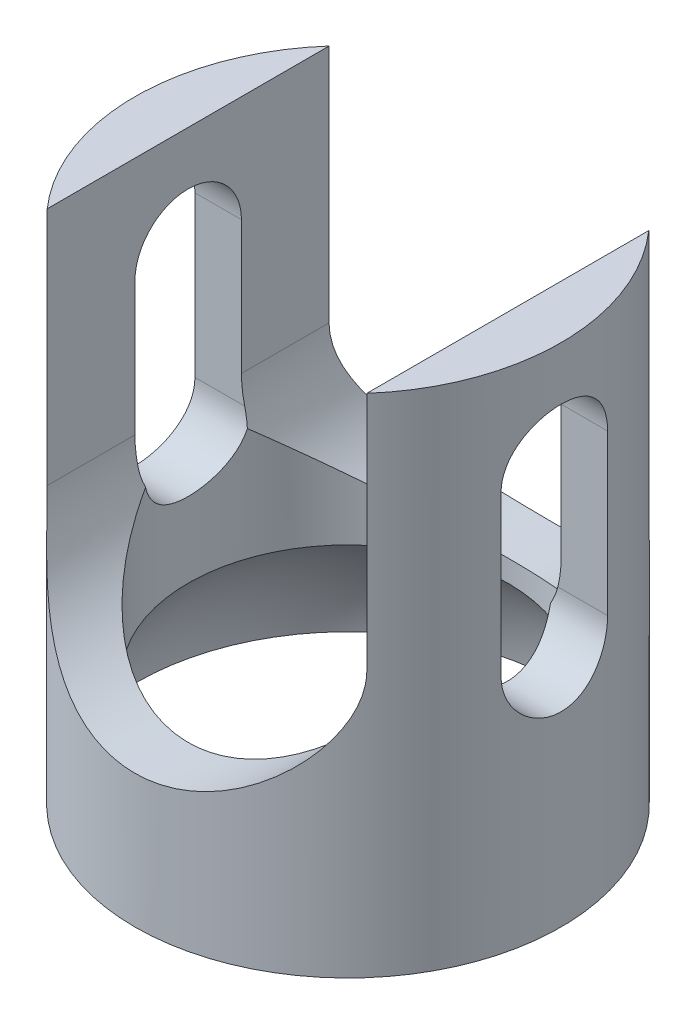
ISO-10303-21;
HEADER;
FILE_DESCRIPTION(('STEP AP214'),'2;1');
FILE_NAME('part.step','',(''),(''),'','','');
FILE_SCHEMA(('AUTOMOTIVE_DESIGN { 1 0 10303 214 1 1 1 1 }'));
ENDSEC;
DATA;
#1=APPLICATION_CONTEXT('core data for automotive mechanical design processes');
#2=APPLICATION_PROTOCOL_DEFINITION('international standard','automotive_design',2000,#1);
#3=PRODUCT_CONTEXT('',#1,'mechanical');
#4=PRODUCT('Part','Part','',(#3));
#5=PRODUCT_RELATED_PRODUCT_CATEGORY('part','',(#4));
#6=PRODUCT_DEFINITION_FORMATION('','',#4);
#7=PRODUCT_DEFINITION_CONTEXT('part definition',#1,'design');
#8=PRODUCT_DEFINITION('design','',#6,#7);
#9=PRODUCT_DEFINITION_SHAPE('','',#8);
#10=(LENGTH_UNIT() NAMED_UNIT(*) SI_UNIT(.MILLI.,.METRE.));
#11=(NAMED_UNIT(*) PLANE_ANGLE_UNIT() SI_UNIT($,.RADIAN.));
#12=(NAMED_UNIT(*) SI_UNIT($,.STERADIAN.) SOLID_ANGLE_UNIT());
#13=UNCERTAINTY_MEASURE_WITH_UNIT(LENGTH_MEASURE(1.E-05),#10,'distance_accuracy_value','');
#14=(GEOMETRIC_REPRESENTATION_CONTEXT(3) GLOBAL_UNCERTAINTY_ASSIGNED_CONTEXT((#13)) GLOBAL_UNIT_ASSIGNED_CONTEXT((#10,
#11,#12)) REPRESENTATION_CONTEXT('',''));
#15=CARTESIAN_POINT('',(0.,0.,0.));
#16=DIRECTION('',(0.,0.,1.));
#17=DIRECTION('',(1.,0.,0.));
#18=AXIS2_PLACEMENT_3D('',#15,#16,#17);
#19=CARTESIAN_POINT('',(0.,0.,0.));
#20=DIRECTION('',(0.,1.,0.));
#21=DIRECTION('',(0.,0.,1.));
#22=AXIS2_PLACEMENT_3D('',#19,#20,#21);
#23=PLANE('',#22);
#24=DIRECTION('',(0.,0.,1.));
#25=VECTOR('',#24,1.);
#26=CARTESIAN_POINT('',(3.,0.,-4.));
#27=LINE('',#26,#25);
#28=CARTESIAN_POINT('',(3.,0.,-2.64575131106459));
#29=VERTEX_POINT('',#28);
#30=CARTESIAN_POINT('',(3.,0.,2.64575131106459));
#31=VERTEX_POINT('',#30);
#32=EDGE_CURVE('E156',#29,#31,#27,.T.);
#33=ORIENTED_EDGE('',*,*,#32,.T.);
#34=CARTESIAN_POINT('',(0.,0.,0.));
#35=DIRECTION('',(0.,1.,0.));
#36=DIRECTION('',(0.,0.,1.));
#37=AXIS2_PLACEMENT_3D('',#34,#35,#36);
#38=CIRCLE('',#37,4.);
#39=EDGE_CURVE('E315',#31,#29,#38,.T.);
#40=ORIENTED_EDGE('',*,*,#39,.T.);
#41=EDGE_LOOP('',(#33,#40));
#42=FACE_BOUND('',#41,.T.);
#43=ADVANCED_FACE('F33',(#42),#23,.T.);
#44=CARTESIAN_POINT('',(0.,-9.5,0.));
#45=DIRECTION('',(0.,1.,0.));
#46=DIRECTION('',(0.,0.,1.));
#47=AXIS2_PLACEMENT_3D('',#44,#45,#46);
#48=CYLINDRICAL_SURFACE('',#47,4.);
#49=DIRECTION('',(0.,1.,0.));
#50=VECTOR('',#49,1.);
#51=CARTESIAN_POINT('',(3.,-9.5,-2.64575131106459));
#52=LINE('',#51,#50);
#53=CARTESIAN_POINT('',(3.,-4.5,-2.64575131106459));
#54=VERTEX_POINT('',#53);
#55=EDGE_CURVE('E150',#29,#54,#52,.F.);
#56=ORIENTED_EDGE('',*,*,#55,.F.);
#57=ORIENTED_EDGE('',*,*,#39,.F.);
#58=DIRECTION('',(0.,1.,0.));
#59=VECTOR('',#58,1.);
#60=CARTESIAN_POINT('',(3.,-9.5,2.64575131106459));
#61=LINE('',#60,#59);
#62=CARTESIAN_POINT('',(3.,-4.5,2.64575131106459));
#63=VERTEX_POINT('',#62);
#64=EDGE_CURVE('E162',#63,#31,#61,.T.);
#65=ORIENTED_EDGE('',*,*,#64,.F.);
#66=CARTESIAN_POINT('',(-3.,-4.5,2.64575131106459));
#67=CARTESIAN_POINT('',(-3.00001954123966,-4.54954928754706,2.64571377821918));
#68=CARTESIAN_POINT('',(-2.99823324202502,-4.59907146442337,2.64775458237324));
#69=CARTESIAN_POINT('',(-2.99120654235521,-4.6974491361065,2.65569815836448));
#70=CARTESIAN_POINT('',(-2.98597395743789,-4.74630588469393,2.66159219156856));
#71=CARTESIAN_POINT('',(-2.97231248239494,-4.84225587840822,2.67683669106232));
#72=CARTESIAN_POINT('',(-2.96393187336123,-4.88936450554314,2.68613489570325));
#73=CARTESIAN_POINT('',(-2.94419676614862,-4.98226231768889,2.70775201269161));
#74=CARTESIAN_POINT('',(-2.93284050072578,-5.02805070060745,2.72007271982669));
#75=CARTESIAN_POINT('',(-2.90432999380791,-5.12893891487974,2.75052684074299));
#76=CARTESIAN_POINT('',(-2.88643801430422,-5.18362301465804,2.7693455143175));
#77=CARTESIAN_POINT('',(-2.84689420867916,-5.29043544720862,2.80998254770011));
#78=CARTESIAN_POINT('',(-2.82524128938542,-5.34256303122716,2.83180177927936));
#79=CARTESIAN_POINT('',(-2.75497130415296,-5.49561098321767,2.90076125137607));
#80=CARTESIAN_POINT('',(-2.70119079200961,-5.5926967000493,2.95123781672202));
#81=CARTESIAN_POINT('',(-2.59857204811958,-5.75158036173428,3.04150496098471));
#82=CARTESIAN_POINT('',(-2.55245748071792,-5.81572881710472,3.08040605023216));
#83=CARTESIAN_POINT('',(-2.45475452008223,-5.93904331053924,3.1588108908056));
#84=CARTESIAN_POINT('',(-2.40317874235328,-5.99822028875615,3.19831308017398));
#85=CARTESIAN_POINT('',(-2.29483074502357,-6.11187827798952,3.27692489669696));
#86=CARTESIAN_POINT('',(-2.23805821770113,-6.1663590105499,3.31603450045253));
#87=CARTESIAN_POINT('',(-2.11955599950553,-6.27069382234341,3.39300405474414));
#88=CARTESIAN_POINT('',(-2.05782368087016,-6.32054541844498,3.43086332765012));
#89=CARTESIAN_POINT('',(-1.92968228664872,-6.41552093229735,3.50453833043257));
#90=CARTESIAN_POINT('',(-1.8632734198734,-6.46064506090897,3.54035415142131));
#91=CARTESIAN_POINT('',(-1.7260483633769,-6.54601338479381,3.60924507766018));
#92=CARTESIAN_POINT('',(-1.65523269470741,-6.58625815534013,3.64232050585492));
#93=CARTESIAN_POINT('',(-1.51264610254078,-6.6600276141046,3.70373664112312));
#94=CARTESIAN_POINT('',(-1.44104796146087,-6.69376720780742,3.73221999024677));
#95=CARTESIAN_POINT('',(-1.29445804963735,-6.75634256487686,3.78555939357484));
#96=CARTESIAN_POINT('',(-1.21946728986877,-6.78517977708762,3.81041651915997));
#97=CARTESIAN_POINT('',(-1.07129942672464,-6.83605858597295,3.85459577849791));
#98=CARTESIAN_POINT('',(-0.998304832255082,-6.85841349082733,3.87416768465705));
#99=CARTESIAN_POINT('',(-0.850048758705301,-6.89842289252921,3.90937836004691));
#100=CARTESIAN_POINT('',(-0.774785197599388,-6.91607291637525,3.92501338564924));
#101=CARTESIAN_POINT('',(-0.550713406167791,-6.96077469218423,3.96474512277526));
#102=CARTESIAN_POINT('',(-0.399385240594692,-6.98103032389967,3.98294709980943));
#103=CARTESIAN_POINT('',(-0.0943029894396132,-7.00201537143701,4.00180536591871));
#104=CARTESIAN_POINT('',(0.0594505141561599,-7.00274940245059,4.00246580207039));
#105=CARTESIAN_POINT('',(0.286716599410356,-6.98934216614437,3.99041678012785));
#106=CARTESIAN_POINT('',(0.361134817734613,-6.98260116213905,3.98435848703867));
#107=CARTESIAN_POINT('',(0.508892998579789,-6.96455371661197,3.96819151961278));
#108=CARTESIAN_POINT('',(0.582233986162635,-6.95325195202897,3.95808699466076));
#109=CARTESIAN_POINT('',(0.800035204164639,-6.91264560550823,3.92193090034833));
#110=CARTESIAN_POINT('',(0.942362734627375,-6.87663455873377,3.89003179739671));
#111=CARTESIAN_POINT('',(1.21921785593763,-6.78761875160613,3.81240761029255));
#112=CARTESIAN_POINT('',(1.35364798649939,-6.73443972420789,3.76654102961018));
#113=CARTESIAN_POINT('',(1.61092533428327,-6.61259830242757,3.66388998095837));
#114=CARTESIAN_POINT('',(1.73376515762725,-6.54392611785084,3.60709861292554));
#115=CARTESIAN_POINT('',(1.91557777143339,-6.42525908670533,3.51227550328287));
#116=CARTESIAN_POINT('',(1.9791331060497,-6.3800913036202,3.47679774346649));
#117=CARTESIAN_POINT('',(2.10171390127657,-6.28531451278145,3.40409520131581));
#118=CARTESIAN_POINT('',(2.16074244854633,-6.23570858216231,3.36687163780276));
#119=CARTESIAN_POINT('',(2.27410344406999,-6.13204515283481,3.29136701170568));
#120=CARTESIAN_POINT('',(2.32843276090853,-6.07798473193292,3.25308526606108));
#121=CARTESIAN_POINT('',(2.4320704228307,-5.96540626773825,3.17634779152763));
#122=CARTESIAN_POINT('',(2.48138121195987,-5.90689041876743,3.13789215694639));
#123=CARTESIAN_POINT('',(2.56960001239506,-5.79183316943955,3.06594785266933));
#124=CARTESIAN_POINT('',(2.60905622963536,-5.73576627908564,3.03237293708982));
#125=CARTESIAN_POINT('',(2.68348380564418,-5.61963826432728,2.96671199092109));
#126=CARTESIAN_POINT('',(2.71844409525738,-5.55956781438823,2.93462975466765));
#127=CARTESIAN_POINT('',(2.77620327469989,-5.44894973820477,2.87991611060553));
#128=CARTESIAN_POINT('',(2.79999133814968,-5.39918394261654,2.85674992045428));
#129=CARTESIAN_POINT('',(2.84416407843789,-5.29711710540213,2.81277471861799));
#130=CARTESIAN_POINT('',(2.86454755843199,-5.24481518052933,2.79196653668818));
#131=CARTESIAN_POINT('',(2.90142928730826,-5.13799374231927,2.75361828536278));
#132=CARTESIAN_POINT('',(2.91794580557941,-5.08348614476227,2.73606293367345));
#133=CARTESIAN_POINT('',(2.94677000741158,-4.97228780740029,2.70499472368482));
#134=CARTESIAN_POINT('',(2.95908169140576,-4.91559920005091,2.69147802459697));
#135=CARTESIAN_POINT('',(2.97918616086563,-4.79979467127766,2.66920990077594));
#136=CARTESIAN_POINT('',(2.98692751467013,-4.7406588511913,2.66051277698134));
#137=CARTESIAN_POINT('',(2.99473743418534,-4.65104843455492,2.6517092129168));
#138=CARTESIAN_POINT('',(2.99670719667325,-4.62092858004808,2.64948145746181));
#139=CARTESIAN_POINT('',(2.99933970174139,-4.56054225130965,2.64650018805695));
#140=CARTESIAN_POINT('',(3.00000170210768,-4.5302757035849,2.64574751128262));
#141=CARTESIAN_POINT('',(3.,-4.5,2.64575131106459));
#142=B_SPLINE_CURVE_WITH_KNOTS('',3,(#66,#67,#68,#69,#70,#71,#72,#73,#74,#75,#76,#77,#78,#79,
#80,#81,#82,#83,#84,#85,#86,#87,#88,#89,#90,#91,#92,#93,#94,#95,#96,#97,#98,#99,#100,#101,#102,
#103,#104,#105,#106,#107,#108,#109,#110,#111,#112,#113,#114,#115,#116,#117,#118,#119,#120,#121,
#122,#123,#124,#125,#126,#127,#128,#129,#130,#131,#132,#133,#134,#135,#136,#137,#138,#139,#140,
#141),.UNSPECIFIED.,.F.,.F.,(4,2,2,2,2,2,2,2,2,2,2,2,2,2,2,2,2,2,2,2,2,2,2,2,2,2,2,2,2,2,2,2,2,
2,2,2,2,4),(0.,0.148530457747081,0.2967252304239,0.442734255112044,0.588830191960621,
0.770139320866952,0.951501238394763,1.3158459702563,1.57976492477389,1.84308699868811,
2.10642467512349,2.36990280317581,2.63336917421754,2.89680445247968,3.14888331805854,
3.40088755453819,3.63704424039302,3.87342464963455,4.33238174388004,4.79123033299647,
5.01591079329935,5.24036143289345,5.68899791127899,6.14233963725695,6.59596863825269,
6.85274249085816,7.10933967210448,7.36610654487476,7.62274776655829,7.85154642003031,
8.08089801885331,8.26020946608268,8.43958381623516,8.61809279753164,8.79643147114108,
8.97674058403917,9.06748224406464,9.15827538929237),.UNSPECIFIED.);
#143=CARTESIAN_POINT('',(-3.,-4.5,2.64575131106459));
#144=VERTEX_POINT('',#143);
#145=EDGE_CURVE('E177',#144,#63,#142,.T.);
#146=ORIENTED_EDGE('',*,*,#145,.F.);
#147=DIRECTION('',(0.,1.,0.));
#148=VECTOR('',#147,1.);
#149=CARTESIAN_POINT('',(-3.,-9.5,2.64575131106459));
#150=LINE('',#149,#148);
#151=CARTESIAN_POINT('',(-3.,0.,2.64575131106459));
#152=VERTEX_POINT('',#151);
#153=EDGE_CURVE('E359',#152,#144,#150,.F.);
#154=ORIENTED_EDGE('',*,*,#153,.F.);
#155=CARTESIAN_POINT('',(-3.,0.,-2.64575131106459));
#156=VERTEX_POINT('',#155);
#157=EDGE_CURVE('E320',#156,#152,#38,.T.);
#158=ORIENTED_EDGE('',*,*,#157,.F.);
#159=DIRECTION('',(0.,1.,0.));
#160=VECTOR('',#159,1.);
#161=CARTESIAN_POINT('',(-3.,-9.5,-2.64575131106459));
#162=LINE('',#161,#160);
#163=CARTESIAN_POINT('',(-3.,-4.5,-2.64575131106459));
#164=VERTEX_POINT('',#163);
#165=EDGE_CURVE('E175',#164,#156,#162,.T.);
#166=ORIENTED_EDGE('',*,*,#165,.F.);
#167=CARTESIAN_POINT('',(3.,-4.5,-2.64575131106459));
#168=CARTESIAN_POINT('',(3.00001954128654,-4.54954928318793,-2.64571377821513));
#169=CARTESIAN_POINT('',(2.99823324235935,-4.59907145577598,-2.64775458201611));
#170=CARTESIAN_POINT('',(2.99120654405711,-4.69744911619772,-2.65569815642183));
#171=CARTESIAN_POINT('',(2.98597396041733,-4.74630585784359,-2.66159218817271));
#172=CARTESIAN_POINT('',(2.97231248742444,-4.84225584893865,-2.67683668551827));
#173=CARTESIAN_POINT('',(2.96393187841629,-4.88936448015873,-2.68613489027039));
#174=CARTESIAN_POINT('',(2.94419676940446,-4.98226230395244,-2.70775200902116));
#175=CARTESIAN_POINT('',(2.93284050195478,-5.02805069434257,-2.72007271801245));
#176=CARTESIAN_POINT('',(2.90432999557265,-5.12893891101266,-2.75052683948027));
#177=CARTESIAN_POINT('',(2.88643801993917,-5.18362300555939,-2.76934551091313));
#178=CARTESIAN_POINT('',(2.84689421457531,-5.29043542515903,-2.80998253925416));
#179=CARTESIAN_POINT('',(2.82524129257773,-5.34256300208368,-2.83180176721));
#180=CARTESIAN_POINT('',(2.75497135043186,-5.49561092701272,-2.90076122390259));
#181=CARTESIAN_POINT('',(2.70119095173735,-5.59269656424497,-2.95123775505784));
#182=CARTESIAN_POINT('',(2.59857188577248,-5.75158053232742,-3.04150504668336));
#183=CARTESIAN_POINT('',(2.5524570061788,-5.81572926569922,-3.08040627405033));
#184=CARTESIAN_POINT('',(2.45475474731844,-5.93904317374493,-3.15881086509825));
#185=CARTESIAN_POINT('',(2.40317999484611,-5.99821930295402,-3.19831266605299));
#186=CARTESIAN_POINT('',(2.29482978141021,-6.1118789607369,-3.27692510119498));
#187=CARTESIAN_POINT('',(2.23805404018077,-6.16636223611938,-3.31603571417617));
#188=CARTESIAN_POINT('',(2.11956174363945,-6.27068921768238,-3.39300182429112));
#189=CARTESIAN_POINT('',(2.05784250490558,-6.32053037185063,-3.43085662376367));
#190=CARTESIAN_POINT('',(1.86568921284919,-6.46295334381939,-3.54132297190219));
#191=CARTESIAN_POINT('',(1.72815771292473,-6.54854072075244,-3.61091273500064));
#192=CARTESIAN_POINT('',(1.44289902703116,-6.69610138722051,-3.73377571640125));
#193=CARTESIAN_POINT('',(1.29587213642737,-6.75893740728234,-3.78762541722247));
#194=CARTESIAN_POINT('',(1.07124356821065,-6.83608057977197,-3.85461686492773));
#195=CARTESIAN_POINT('',(0.998217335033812,-6.85844253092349,-3.87419398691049));
#196=CARTESIAN_POINT('',(0.84995348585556,-6.89844316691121,-3.90939545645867));
#197=CARTESIAN_POINT('',(0.77471650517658,-6.91608319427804,-3.92502092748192));
#198=CARTESIAN_POINT('',(0.62573092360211,-6.94581216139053,-3.95144768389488));
#199=CARTESIAN_POINT('',(0.552054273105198,-6.95810458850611,-3.96242528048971));
#200=CARTESIAN_POINT('',(0.403538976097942,-6.97807431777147,-3.98029727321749));
#201=CARTESIAN_POINT('',(0.328699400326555,-6.98574771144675,-3.98718821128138));
#202=CARTESIAN_POINT('',(0.103654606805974,-7.00164158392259,-4.00146587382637));
#203=CARTESIAN_POINT('',(-0.0475584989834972,-7.00283201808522,-4.00254386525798));
#204=CARTESIAN_POINT('',(-0.348100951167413,-6.98628486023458,-3.98766599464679));
#205=CARTESIAN_POINT('',(-0.497429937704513,-6.96854370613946,-3.97170692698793));
#206=CARTESIAN_POINT('',(-0.716286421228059,-6.92848860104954,-3.93603578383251));
#207=CARTESIAN_POINT('',(-0.788140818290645,-6.91297351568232,-3.92225816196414));
#208=CARTESIAN_POINT('',(-0.929903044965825,-6.87766588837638,-3.89108461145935));
#209=CARTESIAN_POINT('',(-0.999812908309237,-6.85787802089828,-3.87369263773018));
#210=CARTESIAN_POINT('',(-1.20616158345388,-6.79232100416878,-3.81647771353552));
#211=CARTESIAN_POINT('',(-1.33930461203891,-6.74034265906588,-3.77160141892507));
#212=CARTESIAN_POINT('',(-1.59534347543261,-6.62077366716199,-3.67069950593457));
#213=CARTESIAN_POINT('',(-1.71813408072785,-6.5530441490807,-3.61457536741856));
#214=CARTESIAN_POINT('',(-1.95067715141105,-6.40329957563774,-3.49456129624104));
#215=CARTESIAN_POINT('',(-2.06041959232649,-6.32127365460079,-3.43066546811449));
#216=CARTESIAN_POINT('',(-2.22420640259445,-6.17927243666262,-3.32539392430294));
#217=CARTESIAN_POINT('',(-2.28292525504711,-6.12366328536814,-3.28527437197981));
#218=CARTESIAN_POINT('',(-2.39481984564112,-6.00757502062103,-3.20461783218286));
#219=CARTESIAN_POINT('',(-2.44800435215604,-5.94710388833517,-3.16408162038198));
#220=CARTESIAN_POINT('',(-2.54163273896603,-5.82974449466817,-3.08920539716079));
#221=CARTESIAN_POINT('',(-2.58282312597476,-5.77350555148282,-3.05477929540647));
#222=CARTESIAN_POINT('',(-2.66065473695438,-5.65690650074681,-2.98723526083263));
#223=CARTESIAN_POINT('',(-2.6972829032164,-5.59653529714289,-2.95412125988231));
#224=CARTESIAN_POINT('',(-2.75821191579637,-5.48477650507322,-2.89717523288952));
#225=CARTESIAN_POINT('',(-2.78348548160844,-5.43416855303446,-2.87285540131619));
#226=CARTESIAN_POINT('',(-2.83050757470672,-5.33027225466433,-2.82653772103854));
#227=CARTESIAN_POINT('',(-2.85225480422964,-5.27698293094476,-2.80454072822));
#228=CARTESIAN_POINT('',(-2.89170970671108,-5.1680449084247,-2.76384069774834));
#229=CARTESIAN_POINT('',(-2.90943786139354,-5.11240996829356,-2.74512107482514));
#230=CARTESIAN_POINT('',(-2.94051819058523,-4.99877502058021,-2.71180243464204));
#231=CARTESIAN_POINT('',(-2.95387459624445,-4.94077736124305,-2.69719943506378));
#232=CARTESIAN_POINT('',(-2.97628297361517,-4.8199067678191,-2.67245906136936));
#233=CARTESIAN_POINT('',(-2.98509272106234,-4.75693408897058,-2.66257476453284));
#234=CARTESIAN_POINT('',(-2.99399284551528,-4.66136779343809,-2.65255070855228));
#235=CARTESIAN_POINT('',(-2.99624068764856,-4.62920410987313,-2.65000936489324));
#236=CARTESIAN_POINT('',(-2.99924587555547,-4.56469748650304,-2.64660661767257));
#237=CARTESIAN_POINT('',(-3.00000222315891,-4.53235444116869,-2.64574633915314));
#238=CARTESIAN_POINT('',(-3.,-4.5,-2.64575131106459));
#239=B_SPLINE_CURVE_WITH_KNOTS('',3,(#167,#168,#169,#170,#171,#172,#173,#174,#175,#176,#177,
#178,#179,#180,#181,#182,#183,#184,#185,#186,#187,#188,#189,#190,#191,#192,#193,#194,#195,#196,
#197,#198,#199,#200,#201,#202,#203,#204,#205,#206,#207,#208,#209,#210,#211,#212,#213,#214,#215,
#216,#217,#218,#219,#220,#221,#222,#223,#224,#225,#226,#227,#228,#229,#230,#231,#232,#233,#234,
#235,#236,#237,#238),.UNSPECIFIED.,.F.,.F.,(4,2,2,2,2,2,2,2,2,2,2,2,2,2,2,2,2,2,2,2,2,2,2,2,2,2,
2,2,2,2,2,2,2,2,2,4),(0.,0.148530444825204,0.296725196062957,0.442734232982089,
0.588830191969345,0.770139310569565,0.951501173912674,1.31584597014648,1.57976525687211,
1.84308699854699,2.10642293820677,2.36990280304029,2.89637101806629,3.40002016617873,
3.63632234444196,3.87255726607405,4.09878550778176,4.32520490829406,4.77656597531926,
5.22801198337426,5.45217781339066,5.67609963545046,6.12368289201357,6.575372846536,
7.02740760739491,7.29798437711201,7.56812571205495,7.8011499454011,8.03482650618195,
8.21937643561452,8.40399412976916,8.5876487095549,8.77112501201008,8.96356674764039,
9.06052344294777,9.15754500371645),.UNSPECIFIED.);
#240=EDGE_CURVE('E167',#54,#164,#239,.T.);
#241=ORIENTED_EDGE('',*,*,#240,.F.);
#242=EDGE_LOOP('',(#56,#57,#65,#146,#154,#158,#166,#241));
#243=FACE_BOUND('',#242,.T.);
#244=CARTESIAN_POINT('',(-3.87298334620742,-5.,-0.999999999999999));
#245=CARTESIAN_POINT('',(-3.87298148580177,-5.02766298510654,-1.00000033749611));
#246=CARTESIAN_POINT('',(-3.87328009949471,-5.05531226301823,-0.998851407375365));
#247=CARTESIAN_POINT('',(-3.87445904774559,-5.11040403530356,-0.994271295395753));
#248=CARTESIAN_POINT('',(-3.87533928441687,-5.13784656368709,-0.990840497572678));
#249=CARTESIAN_POINT('',(-3.87881710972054,-5.21945317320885,-0.977175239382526));
#250=CARTESIAN_POINT('',(-3.88225203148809,-5.27305646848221,-0.963567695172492));
#251=CARTESIAN_POINT('',(-3.89095422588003,-5.37712467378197,-0.927798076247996));
#252=CARTESIAN_POINT('',(-3.8962213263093,-5.42758987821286,-0.905636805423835));
#253=CARTESIAN_POINT('',(-3.90799134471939,-5.52411144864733,-0.853415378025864));
#254=CARTESIAN_POINT('',(-3.91449459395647,-5.57016662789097,-0.823353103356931));
#255=CARTESIAN_POINT('',(-3.92816262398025,-5.6575438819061,-0.755484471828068));
#256=CARTESIAN_POINT('',(-3.93533791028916,-5.69875488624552,-0.717537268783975));
#257=CARTESIAN_POINT('',(-3.94945104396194,-5.77430208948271,-0.635275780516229));
#258=CARTESIAN_POINT('',(-3.95638885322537,-5.80863718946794,-0.59096047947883));
#259=CARTESIAN_POINT('',(-3.96936182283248,-5.86991100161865,-0.49645689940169));
#260=CARTESIAN_POINT('',(-3.9753830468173,-5.89673989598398,-0.446195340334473));
#261=CARTESIAN_POINT('',(-3.98572346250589,-5.94152473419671,-0.341702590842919));
#262=CARTESIAN_POINT('',(-3.99004298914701,-5.95948242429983,-0.287472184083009));
#263=CARTESIAN_POINT('',(-3.99641900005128,-5.98565899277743,-0.17774410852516));
#264=CARTESIAN_POINT('',(-3.99851952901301,-5.99406767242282,-0.122294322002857));
#265=CARTESIAN_POINT('',(-4.00037438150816,-6.0015033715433,-0.0107327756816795));
#266=CARTESIAN_POINT('',(-4.00012899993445,-6.00053157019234,0.0453789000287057));
#267=CARTESIAN_POINT('',(-3.99735237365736,-5.98937003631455,0.155352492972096));
#268=CARTESIAN_POINT('',(-3.99487198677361,-5.97938538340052,0.209236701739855));
#269=CARTESIAN_POINT('',(-3.98796330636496,-5.95081132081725,0.31453871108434));
#270=CARTESIAN_POINT('',(-3.98353492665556,-5.93222153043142,0.365956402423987));
#271=CARTESIAN_POINT('',(-3.97314997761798,-5.88679871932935,0.465407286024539));
#272=CARTESIAN_POINT('',(-3.96717993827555,-5.85989260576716,0.513405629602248));
#273=CARTESIAN_POINT('',(-3.95435945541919,-5.79865687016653,0.604276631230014));
#274=CARTESIAN_POINT('',(-3.94750887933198,-5.76432612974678,0.647148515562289));
#275=CARTESIAN_POINT('',(-3.93345566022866,-5.68812108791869,0.72776938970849));
#276=CARTESIAN_POINT('',(-3.92624850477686,-5.64606836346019,0.765349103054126));
#277=CARTESIAN_POINT('',(-3.91246168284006,-5.55617013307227,0.832969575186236));
#278=CARTESIAN_POINT('',(-3.90588218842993,-5.50832304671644,0.863008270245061));
#279=CARTESIAN_POINT('',(-3.89407813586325,-5.40785440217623,0.914804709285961));
#280=CARTESIAN_POINT('',(-3.88886106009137,-5.35520853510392,0.936517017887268));
#281=CARTESIAN_POINT('',(-3.88047058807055,-5.24688307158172,0.970702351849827));
#282=CARTESIAN_POINT('',(-3.87729413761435,-5.19120814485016,0.983189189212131));
#283=CARTESIAN_POINT('',(-3.87455290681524,-5.1125426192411,0.993904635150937));
#284=CARTESIAN_POINT('',(-3.8739652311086,-5.09008029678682,0.996190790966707));
#285=CARTESIAN_POINT('',(-3.87318062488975,-5.04508221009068,0.999236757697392));
#286=CARTESIAN_POINT('',(-3.87298306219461,-5.02254662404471,0.999999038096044));
#287=CARTESIAN_POINT('',(-3.87298334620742,-5.,0.999999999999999));
#288=B_SPLINE_CURVE_WITH_KNOTS('',3,(#244,#245,#246,#247,#248,#249,#250,#251,#252,#253,#254,
#255,#256,#257,#258,#259,#260,#261,#262,#263,#264,#265,#266,#267,#268,#269,#270,#271,#272,#273,
#274,#275,#276,#277,#278,#279,#280,#281,#282,#283,#284,#285,#286,#287),.UNSPECIFIED.,.F.,.F.,(4,
2,2,2,2,2,2,2,2,2,2,2,2,2,2,2,2,2,2,2,2,4),(0.,0.0829365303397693,0.165859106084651,
0.331229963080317,0.496585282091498,0.66198497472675,0.830641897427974,0.999325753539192,
1.17036187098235,1.34136430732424,1.50890481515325,1.67642426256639,1.84022545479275,
2.00403389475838,2.16932509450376,2.33464120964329,2.50441429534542,2.67423379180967,
2.84496720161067,3.01544447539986,3.08315848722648,3.15076267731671),.UNSPECIFIED.);
#289=CARTESIAN_POINT('',(-3.87298334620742,-5.,-0.999999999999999));
#290=VERTEX_POINT('',#289);
#291=CARTESIAN_POINT('',(-3.87298334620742,-5.,0.999999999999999));
#292=VERTEX_POINT('',#291);
#293=EDGE_CURVE('E58',#290,#292,#288,.T.);
#294=ORIENTED_EDGE('',*,*,#293,.F.);
#295=DIRECTION('',(0.,1.,0.));
#296=VECTOR('',#295,1.);
#297=CARTESIAN_POINT('',(-3.87298334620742,-9.5,-0.999999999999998));
#298=LINE('',#297,#296);
#299=CARTESIAN_POINT('',(-3.87298334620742,-2.,-1.));
#300=VERTEX_POINT('',#299);
#301=EDGE_CURVE('E336',#300,#290,#298,.F.);
#302=ORIENTED_EDGE('',*,*,#301,.F.);
#303=CARTESIAN_POINT('',(-3.87298334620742,-2.,1.));
#304=CARTESIAN_POINT('',(-3.87298148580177,-1.97233701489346,1.00000033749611));
#305=CARTESIAN_POINT('',(-3.87328009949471,-1.94468773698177,0.998851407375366));
#306=CARTESIAN_POINT('',(-3.87445904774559,-1.88959596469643,0.994271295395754));
#307=CARTESIAN_POINT('',(-3.87533928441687,-1.86215343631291,0.990840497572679));
#308=CARTESIAN_POINT('',(-3.87881710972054,-1.78054682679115,0.977175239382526));
#309=CARTESIAN_POINT('',(-3.88225203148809,-1.72694353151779,0.963567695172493));
#310=CARTESIAN_POINT('',(-3.89095422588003,-1.62287532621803,0.927798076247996));
#311=CARTESIAN_POINT('',(-3.8962213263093,-1.57241012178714,0.905636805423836));
#312=CARTESIAN_POINT('',(-3.90799134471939,-1.47588855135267,0.853415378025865));
#313=CARTESIAN_POINT('',(-3.91449459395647,-1.42983337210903,0.823353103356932));
#314=CARTESIAN_POINT('',(-3.92816262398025,-1.3424561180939,0.755484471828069));
#315=CARTESIAN_POINT('',(-3.93533791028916,-1.30124511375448,0.717537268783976));
#316=CARTESIAN_POINT('',(-3.94945104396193,-1.22569791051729,0.63527578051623));
#317=CARTESIAN_POINT('',(-3.95638885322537,-1.19136281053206,0.590960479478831));
#318=CARTESIAN_POINT('',(-3.96936182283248,-1.13008899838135,0.49645689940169));
#319=CARTESIAN_POINT('',(-3.9753830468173,-1.10326010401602,0.446195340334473));
#320=CARTESIAN_POINT('',(-3.98572346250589,-1.05847526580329,0.341702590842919));
#321=CARTESIAN_POINT('',(-3.99004298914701,-1.04051757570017,0.28747218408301));
#322=CARTESIAN_POINT('',(-3.99641900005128,-1.01434100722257,0.17774410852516));
#323=CARTESIAN_POINT('',(-3.99851952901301,-1.00593232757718,0.122294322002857));
#324=CARTESIAN_POINT('',(-4.00037438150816,-0.998496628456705,0.0107327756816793));
#325=CARTESIAN_POINT('',(-4.00012899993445,-0.999468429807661,-0.0453789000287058));
#326=CARTESIAN_POINT('',(-3.99735237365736,-1.01062996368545,-0.155352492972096));
#327=CARTESIAN_POINT('',(-3.99487198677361,-1.02061461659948,-0.209236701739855));
#328=CARTESIAN_POINT('',(-3.98796330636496,-1.04918867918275,-0.31453871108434));
#329=CARTESIAN_POINT('',(-3.98353492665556,-1.06777846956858,-0.365956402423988));
#330=CARTESIAN_POINT('',(-3.97314997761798,-1.11320128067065,-0.465407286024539));
#331=CARTESIAN_POINT('',(-3.96717993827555,-1.14010739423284,-0.513405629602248));
#332=CARTESIAN_POINT('',(-3.95435945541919,-1.20134312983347,-0.604276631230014));
#333=CARTESIAN_POINT('',(-3.94750887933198,-1.23567387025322,-0.647148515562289));
#334=CARTESIAN_POINT('',(-3.93345566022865,-1.31187891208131,-0.72776938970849));
#335=CARTESIAN_POINT('',(-3.92624850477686,-1.35393163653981,-0.765349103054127));
#336=CARTESIAN_POINT('',(-3.91246168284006,-1.44382986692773,-0.832969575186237));
#337=CARTESIAN_POINT('',(-3.90588218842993,-1.49167695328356,-0.863008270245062));
#338=CARTESIAN_POINT('',(-3.89407813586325,-1.59214559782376,-0.914804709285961));
#339=CARTESIAN_POINT('',(-3.88886106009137,-1.64479146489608,-0.936517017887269));
#340=CARTESIAN_POINT('',(-3.88047058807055,-1.75311692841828,-0.970702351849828));
#341=CARTESIAN_POINT('',(-3.87729413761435,-1.80879185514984,-0.983189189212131));
#342=CARTESIAN_POINT('',(-3.87455290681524,-1.8874573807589,-0.993904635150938));
#343=CARTESIAN_POINT('',(-3.8739652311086,-1.90991970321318,-0.996190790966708));
#344=CARTESIAN_POINT('',(-3.87318062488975,-1.95491778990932,-0.999236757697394));
#345=CARTESIAN_POINT('',(-3.87298306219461,-1.97745337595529,-0.999999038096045));
#346=CARTESIAN_POINT('',(-3.87298334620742,-2.,-1.));
#347=B_SPLINE_CURVE_WITH_KNOTS('',3,(#303,#304,#305,#306,#307,#308,#309,#310,#311,#312,#313,
#314,#315,#316,#317,#318,#319,#320,#321,#322,#323,#324,#325,#326,#327,#328,#329,#330,#331,#332,
#333,#334,#335,#336,#337,#338,#339,#340,#341,#342,#343,#344,#345,#346),.UNSPECIFIED.,.F.,.F.,(4,
2,2,2,2,2,2,2,2,2,2,2,2,2,2,2,2,2,2,2,2,4),(0.,0.0829365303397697,0.165859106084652,
0.331229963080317,0.496585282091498,0.661984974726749,0.830641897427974,0.999325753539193,
1.17036187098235,1.34136430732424,1.50890481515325,1.67642426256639,1.84022545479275,
2.00403389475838,2.16932509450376,2.33464120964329,2.50441429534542,2.67423379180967,
2.84496720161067,3.01544447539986,3.08315848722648,3.15076267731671),.UNSPECIFIED.);
#348=CARTESIAN_POINT('',(-3.87298334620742,-2.,1.));
#349=VERTEX_POINT('',#348);
#350=EDGE_CURVE('E324',#349,#300,#347,.T.);
#351=ORIENTED_EDGE('',*,*,#350,.F.);
#352=DIRECTION('',(0.,1.,0.));
#353=VECTOR('',#352,1.);
#354=CARTESIAN_POINT('',(-3.87298334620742,-9.5,0.999999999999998));
#355=LINE('',#354,#353);
#356=EDGE_CURVE('E349',#292,#349,#355,.T.);
#357=ORIENTED_EDGE('',*,*,#356,.F.);
#358=EDGE_LOOP('',(#294,#302,#351,#357));
#359=FACE_BOUND('',#358,.T.);
#360=CARTESIAN_POINT('',(3.87298334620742,-5.,0.999999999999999));
#361=CARTESIAN_POINT('',(3.87298148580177,-5.02766298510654,1.00000033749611));
#362=CARTESIAN_POINT('',(3.87328009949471,-5.05531226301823,0.998851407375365));
#363=CARTESIAN_POINT('',(3.87445904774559,-5.11040403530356,0.994271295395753));
#364=CARTESIAN_POINT('',(3.87533928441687,-5.13784656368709,0.990840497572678));
#365=CARTESIAN_POINT('',(3.87881710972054,-5.21945317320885,0.977175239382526));
#366=CARTESIAN_POINT('',(3.88225203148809,-5.27305646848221,0.963567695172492));
#367=CARTESIAN_POINT('',(3.89095422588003,-5.37712467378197,0.927798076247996));
#368=CARTESIAN_POINT('',(3.8962213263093,-5.42758987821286,0.905636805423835));
#369=CARTESIAN_POINT('',(3.90799134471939,-5.52411144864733,0.853415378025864));
#370=CARTESIAN_POINT('',(3.91449459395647,-5.57016662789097,0.823353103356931));
#371=CARTESIAN_POINT('',(3.92816262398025,-5.6575438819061,0.755484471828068));
#372=CARTESIAN_POINT('',(3.93533791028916,-5.69875488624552,0.717537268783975));
#373=CARTESIAN_POINT('',(3.94945104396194,-5.77430208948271,0.635275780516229));
#374=CARTESIAN_POINT('',(3.95638885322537,-5.80863718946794,0.59096047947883));
#375=CARTESIAN_POINT('',(3.96936182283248,-5.86991100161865,0.49645689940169));
#376=CARTESIAN_POINT('',(3.9753830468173,-5.89673989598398,0.446195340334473));
#377=CARTESIAN_POINT('',(3.98572346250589,-5.94152473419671,0.341702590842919));
#378=CARTESIAN_POINT('',(3.99004298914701,-5.95948242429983,0.287472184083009));
#379=CARTESIAN_POINT('',(3.99641900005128,-5.98565899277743,0.17774410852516));
#380=CARTESIAN_POINT('',(3.99851952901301,-5.99406767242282,0.122294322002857));
#381=CARTESIAN_POINT('',(4.00037438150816,-6.0015033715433,0.0107327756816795));
#382=CARTESIAN_POINT('',(4.00012899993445,-6.00053157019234,-0.0453789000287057));
#383=CARTESIAN_POINT('',(3.99735237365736,-5.98937003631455,-0.155352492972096));
#384=CARTESIAN_POINT('',(3.99487198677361,-5.97938538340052,-0.209236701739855));
#385=CARTESIAN_POINT('',(3.98796330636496,-5.95081132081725,-0.31453871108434));
#386=CARTESIAN_POINT('',(3.98353492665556,-5.93222153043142,-0.365956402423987));
#387=CARTESIAN_POINT('',(3.97314997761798,-5.88679871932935,-0.465407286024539));
#388=CARTESIAN_POINT('',(3.96717993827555,-5.85989260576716,-0.513405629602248));
#389=CARTESIAN_POINT('',(3.95435945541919,-5.79865687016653,-0.604276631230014));
#390=CARTESIAN_POINT('',(3.94750887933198,-5.76432612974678,-0.647148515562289));
#391=CARTESIAN_POINT('',(3.93345566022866,-5.68812108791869,-0.72776938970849));
#392=CARTESIAN_POINT('',(3.92624850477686,-5.64606836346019,-0.765349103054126));
#393=CARTESIAN_POINT('',(3.91246168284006,-5.55617013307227,-0.832969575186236));
#394=CARTESIAN_POINT('',(3.90588218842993,-5.50832304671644,-0.863008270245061));
#395=CARTESIAN_POINT('',(3.89407813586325,-5.40785440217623,-0.914804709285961));
#396=CARTESIAN_POINT('',(3.88886106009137,-5.35520853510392,-0.936517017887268));
#397=CARTESIAN_POINT('',(3.88047058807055,-5.24688307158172,-0.970702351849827));
#398=CARTESIAN_POINT('',(3.87729413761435,-5.19120814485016,-0.983189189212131));
#399=CARTESIAN_POINT('',(3.87455290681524,-5.1125426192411,-0.993904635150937));
#400=CARTESIAN_POINT('',(3.8739652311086,-5.09008029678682,-0.996190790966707));
#401=CARTESIAN_POINT('',(3.87318062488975,-5.04508221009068,-0.999236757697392));
#402=CARTESIAN_POINT('',(3.87298306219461,-5.02254662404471,-0.999999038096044));
#403=CARTESIAN_POINT('',(3.87298334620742,-5.,-0.999999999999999));
#404=B_SPLINE_CURVE_WITH_KNOTS('',3,(#360,#361,#362,#363,#364,#365,#366,#367,#368,#369,#370,
#371,#372,#373,#374,#375,#376,#377,#378,#379,#380,#381,#382,#383,#384,#385,#386,#387,#388,#389,
#390,#391,#392,#393,#394,#395,#396,#397,#398,#399,#400,#401,#402,#403),.UNSPECIFIED.,.F.,.F.,(4,
2,2,2,2,2,2,2,2,2,2,2,2,2,2,2,2,2,2,2,2,4),(0.,0.0829365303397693,0.165859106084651,
0.331229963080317,0.496585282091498,0.66198497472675,0.830641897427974,0.999325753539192,
1.17036187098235,1.34136430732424,1.50890481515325,1.67642426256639,1.84022545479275,
2.00403389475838,2.16932509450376,2.33464120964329,2.50441429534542,2.67423379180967,
2.84496720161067,3.01544447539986,3.08315848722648,3.15076267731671),.UNSPECIFIED.);
#405=CARTESIAN_POINT('',(3.87298334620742,-5.,0.999999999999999));
#406=VERTEX_POINT('',#405);
#407=CARTESIAN_POINT('',(3.87298334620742,-5.,-0.999999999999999));
#408=VERTEX_POINT('',#407);
#409=EDGE_CURVE('E256',#406,#408,#404,.T.);
#410=ORIENTED_EDGE('',*,*,#409,.F.);
#411=DIRECTION('',(0.,1.,0.));
#412=VECTOR('',#411,1.);
#413=CARTESIAN_POINT('',(3.87298334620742,-9.5,0.999999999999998));
#414=LINE('',#413,#412);
#415=CARTESIAN_POINT('',(3.87298334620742,-2.,1.));
#416=VERTEX_POINT('',#415);
#417=EDGE_CURVE('E344',#416,#406,#414,.F.);
#418=ORIENTED_EDGE('',*,*,#417,.F.);
#419=CARTESIAN_POINT('',(3.87298334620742,-2.,-1.));
#420=CARTESIAN_POINT('',(3.87298148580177,-1.97233701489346,-1.00000033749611));
#421=CARTESIAN_POINT('',(3.87328009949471,-1.94468773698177,-0.998851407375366));
#422=CARTESIAN_POINT('',(3.87445904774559,-1.88959596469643,-0.994271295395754));
#423=CARTESIAN_POINT('',(3.87533928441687,-1.86215343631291,-0.990840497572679));
#424=CARTESIAN_POINT('',(3.87881710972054,-1.78054682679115,-0.977175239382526));
#425=CARTESIAN_POINT('',(3.88225203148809,-1.72694353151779,-0.963567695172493));
#426=CARTESIAN_POINT('',(3.89095422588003,-1.62287532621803,-0.927798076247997));
#427=CARTESIAN_POINT('',(3.8962213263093,-1.57241012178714,-0.905636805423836));
#428=CARTESIAN_POINT('',(3.90799134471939,-1.47588855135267,-0.853415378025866));
#429=CARTESIAN_POINT('',(3.91449459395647,-1.42983337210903,-0.823353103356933));
#430=CARTESIAN_POINT('',(3.92816262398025,-1.3424561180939,-0.755484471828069));
#431=CARTESIAN_POINT('',(3.93533791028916,-1.30124511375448,-0.717537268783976));
#432=CARTESIAN_POINT('',(3.94945104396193,-1.22569791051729,-0.63527578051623));
#433=CARTESIAN_POINT('',(3.95638885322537,-1.19136281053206,-0.590960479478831));
#434=CARTESIAN_POINT('',(3.96936182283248,-1.13008899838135,-0.496456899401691));
#435=CARTESIAN_POINT('',(3.9753830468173,-1.10326010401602,-0.446195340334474));
#436=CARTESIAN_POINT('',(3.98572346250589,-1.05847526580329,-0.341702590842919));
#437=CARTESIAN_POINT('',(3.99004298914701,-1.04051757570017,-0.28747218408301));
#438=CARTESIAN_POINT('',(3.99641900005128,-1.01434100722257,-0.177744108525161));
#439=CARTESIAN_POINT('',(3.99851952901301,-1.00593232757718,-0.122294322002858));
#440=CARTESIAN_POINT('',(4.00037438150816,-0.998496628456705,-0.0107327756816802));
#441=CARTESIAN_POINT('',(4.00012899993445,-0.999468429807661,0.045378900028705));
#442=CARTESIAN_POINT('',(3.99735237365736,-1.01062996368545,0.155352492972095));
#443=CARTESIAN_POINT('',(3.99487198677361,-1.02061461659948,0.209236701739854));
#444=CARTESIAN_POINT('',(3.98796330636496,-1.04918867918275,0.314538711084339));
#445=CARTESIAN_POINT('',(3.98353492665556,-1.06777846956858,0.365956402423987));
#446=CARTESIAN_POINT('',(3.97314997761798,-1.11320128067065,0.465407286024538));
#447=CARTESIAN_POINT('',(3.96717993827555,-1.14010739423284,0.513405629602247));
#448=CARTESIAN_POINT('',(3.95435945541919,-1.20134312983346,0.604276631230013));
#449=CARTESIAN_POINT('',(3.94750887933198,-1.23567387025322,0.647148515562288));
#450=CARTESIAN_POINT('',(3.93345566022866,-1.31187891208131,0.72776938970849));
#451=CARTESIAN_POINT('',(3.92624850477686,-1.35393163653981,0.765349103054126));
#452=CARTESIAN_POINT('',(3.91246168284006,-1.44382986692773,0.832969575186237));
#453=CARTESIAN_POINT('',(3.90588218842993,-1.49167695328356,0.863008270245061));
#454=CARTESIAN_POINT('',(3.89407813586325,-1.59214559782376,0.914804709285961));
#455=CARTESIAN_POINT('',(3.88886106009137,-1.64479146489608,0.936517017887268));
#456=CARTESIAN_POINT('',(3.88047058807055,-1.75311692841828,0.970702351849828));
#457=CARTESIAN_POINT('',(3.87729413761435,-1.80879185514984,0.98318918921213));
#458=CARTESIAN_POINT('',(3.87455290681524,-1.8874573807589,0.993904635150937));
#459=CARTESIAN_POINT('',(3.8739652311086,-1.90991970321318,0.996190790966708));
#460=CARTESIAN_POINT('',(3.87318062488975,-1.95491778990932,0.999236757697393));
#461=CARTESIAN_POINT('',(3.87298306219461,-1.97745337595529,0.999999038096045));
#462=CARTESIAN_POINT('',(3.87298334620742,-2.,1.));
#463=B_SPLINE_CURVE_WITH_KNOTS('',3,(#419,#420,#421,#422,#423,#424,#425,#426,#427,#428,#429,
#430,#431,#432,#433,#434,#435,#436,#437,#438,#439,#440,#441,#442,#443,#444,#445,#446,#447,#448,
#449,#450,#451,#452,#453,#454,#455,#456,#457,#458,#459,#460,#461,#462),.UNSPECIFIED.,.F.,.F.,(4,
2,2,2,2,2,2,2,2,2,2,2,2,2,2,2,2,2,2,2,2,4),(0.,0.0829365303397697,0.165859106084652,
0.331229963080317,0.496585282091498,0.661984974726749,0.830641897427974,0.999325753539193,
1.17036187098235,1.34136430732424,1.50890481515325,1.67642426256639,1.84022545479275,
2.00403389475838,2.16932509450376,2.33464120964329,2.50441429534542,2.67423379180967,
2.84496720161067,3.01544447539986,3.08315848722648,3.15076267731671),.UNSPECIFIED.);
#464=CARTESIAN_POINT('',(3.87298334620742,-2.,-1.));
#465=VERTEX_POINT('',#464);
#466=EDGE_CURVE('E330',#465,#416,#463,.T.);
#467=ORIENTED_EDGE('',*,*,#466,.F.);
#468=DIRECTION('',(0.,1.,0.));
#469=VECTOR('',#468,1.);
#470=CARTESIAN_POINT('',(3.87298334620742,-9.5,-0.999999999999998));
#471=LINE('',#470,#469);
#472=EDGE_CURVE('E337',#408,#465,#471,.T.);
#473=ORIENTED_EDGE('',*,*,#472,.F.);
#474=EDGE_LOOP('',(#410,#418,#467,#473));
#475=FACE_BOUND('',#474,.T.);
#476=CARTESIAN_POINT('',(0.,-9.5,0.));
#477=DIRECTION('',(0.,1.,0.));
#478=DIRECTION('',(0.,0.,1.));
#479=AXIS2_PLACEMENT_3D('',#476,#477,#478);
#480=CIRCLE('',#479,4.);
#481=CARTESIAN_POINT('',(0.,-9.5,4.));
#482=VERTEX_POINT('',#481);
#483=EDGE_CURVE('E319',#482,#482,#480,.T.);
#484=ORIENTED_EDGE('',*,*,#483,.T.);
#485=EDGE_LOOP('',(#484));
#486=FACE_BOUND('',#485,.T.);
#487=ADVANCED_FACE('F35',(#243,#359,#475,#486),#48,.T.);
#488=CARTESIAN_POINT('',(0.,-9.5,0.));
#489=DIRECTION('',(0.,1.,0.));
#490=DIRECTION('',(0.,0.,1.));
#491=AXIS2_PLACEMENT_3D('',#488,#489,#490);
#492=PLANE('',#491);
#493=CARTESIAN_POINT('',(0.,-9.5,0.));
#494=DIRECTION('',(0.,1.,0.));
#495=DIRECTION('',(0.,0.,1.));
#496=AXIS2_PLACEMENT_3D('',#493,#494,#495);
#497=CIRCLE('',#496,3.96141494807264);
#498=CARTESIAN_POINT('',(3.96141494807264,-9.5,0.));
#499=VERTEX_POINT('',#498);
#500=EDGE_CURVE('E208',#499,#499,#497,.T.);
#501=ORIENTED_EDGE('',*,*,#500,.T.);
#502=EDGE_LOOP('',(#501));
#503=FACE_BOUND('',#502,.T.);
#504=ORIENTED_EDGE('',*,*,#483,.F.);
#505=EDGE_LOOP('',(#504));
#506=FACE_BOUND('',#505,.T.);
#507=ADVANCED_FACE('F299',(#503,#506),#492,.F.);
#508=DIRECTION('',(0.,0.,1.));
#509=VECTOR('',#508,1.);
#510=CARTESIAN_POINT('',(-3.,0.,-4.));
#511=LINE('',#510,#509);
#512=EDGE_CURVE('E215',#156,#152,#511,.T.);
#513=ORIENTED_EDGE('',*,*,#512,.F.);
#514=ORIENTED_EDGE('',*,*,#157,.T.);
#515=EDGE_LOOP('',(#513,#514));
#516=FACE_BOUND('',#515,.T.);
#517=ADVANCED_FACE('F295',(#516),#23,.T.);
#518=CARTESIAN_POINT('',(0.,-9.5,0.));
#519=DIRECTION('',(0.,1.,0.));
#520=DIRECTION('',(0.,0.,1.));
#521=AXIS2_PLACEMENT_3D('',#518,#519,#520);
#522=CYLINDRICAL_SURFACE('',#521,3.);
#523=CARTESIAN_POINT('',(0.,-7.40849737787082,0.));
#524=DIRECTION('',(0.,-1.,0.));
#525=DIRECTION('',(0.,0.,-1.));
#526=AXIS2_PLACEMENT_3D('',#523,#524,#525);
#527=CIRCLE('',#526,3.);
#528=CARTESIAN_POINT('',(3.,-7.40849737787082,0.));
#529=VERTEX_POINT('',#528);
#530=EDGE_CURVE('E38',#529,#529,#527,.T.);
#531=ORIENTED_EDGE('',*,*,#530,.T.);
#532=EDGE_LOOP('',(#531));
#533=FACE_BOUND('',#532,.T.);
#534=CARTESIAN_POINT('',(2.82842712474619,-5.,0.999999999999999));
#535=CARTESIAN_POINT('',(2.82842442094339,-5.02729049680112,1.0000007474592));
#536=CARTESIAN_POINT('',(2.82882259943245,-5.05456706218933,0.998882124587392));
#537=CARTESIAN_POINT('',(2.83039327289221,-5.1089085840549,0.994425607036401));
#538=CARTESIAN_POINT('',(2.83156555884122,-5.13597359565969,0.991088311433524));
#539=CARTESIAN_POINT('',(2.83619092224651,-5.21639214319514,0.977810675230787));
#540=CARTESIAN_POINT('',(2.84075292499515,-5.26918084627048,0.964604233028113));
#541=CARTESIAN_POINT('',(2.85228074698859,-5.37162519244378,0.929958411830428));
#542=CARTESIAN_POINT('',(2.85924523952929,-5.42128254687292,0.908523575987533));
#543=CARTESIAN_POINT('',(2.87478787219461,-5.51633983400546,0.858073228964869));
#544=CARTESIAN_POINT('',(2.88336700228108,-5.56173712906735,0.829053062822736));
#545=CARTESIAN_POINT('',(2.90154480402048,-5.64872023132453,0.763051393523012));
#546=CARTESIAN_POINT('',(2.91116877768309,-5.69011488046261,0.725824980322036));
#547=CARTESIAN_POINT('',(2.93013848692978,-5.7662060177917,0.644988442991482));
#548=CARTESIAN_POINT('',(2.93948417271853,-5.80090131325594,0.601377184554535));
#549=CARTESIAN_POINT('',(2.95713882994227,-5.8634795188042,0.507603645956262));
#550=CARTESIAN_POINT('',(2.96541437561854,-5.89116098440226,0.457300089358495));
#551=CARTESIAN_POINT('',(2.97969608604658,-5.93759225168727,0.352429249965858));
#552=CARTESIAN_POINT('',(2.9857029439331,-5.95634478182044,0.297863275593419));
#553=CARTESIAN_POINT('',(2.99459071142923,-5.98373572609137,0.188029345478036));
#554=CARTESIAN_POINT('',(2.99757308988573,-5.99270327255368,0.132851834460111));
#555=CARTESIAN_POINT('',(3.00043608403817,-6.00131629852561,0.0216989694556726));
#556=CARTESIAN_POINT('',(3.00031743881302,-6.00096399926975,-0.0342761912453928));
#557=CARTESIAN_POINT('',(2.99706038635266,-5.99115571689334,-0.143103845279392));
#558=CARTESIAN_POINT('',(2.99404060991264,-5.98205736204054,-0.195992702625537));
#559=CARTESIAN_POINT('',(2.98546960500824,-5.95560680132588,-0.299444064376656));
#560=CARTESIAN_POINT('',(2.97991823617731,-5.93825413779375,-0.350006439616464));
#561=CARTESIAN_POINT('',(2.96675668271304,-5.89557863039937,-0.448152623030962));
#562=CARTESIAN_POINT('',(2.95912037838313,-5.87015395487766,-0.495688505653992));
#563=CARTESIAN_POINT('',(2.94258387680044,-5.8121400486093,-0.585924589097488));
#564=CARTESIAN_POINT('',(2.93368333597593,-5.77954886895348,-0.628623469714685));
#565=CARTESIAN_POINT('',(2.9150627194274,-5.70632895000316,-0.710097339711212));
#566=CARTESIAN_POINT('',(2.90532378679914,-5.66539445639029,-0.748593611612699));
#567=CARTESIAN_POINT('',(2.88647490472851,-5.57755851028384,-0.818272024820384));
#568=CARTESIAN_POINT('',(2.87736515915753,-5.53065513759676,-0.849451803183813));
#569=CARTESIAN_POINT('',(2.86070031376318,-5.43131982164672,-0.904003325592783));
#570=CARTESIAN_POINT('',(2.85317014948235,-5.37881648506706,-0.927253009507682));
#571=CARTESIAN_POINT('',(2.84081097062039,-5.27035302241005,-0.964460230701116));
#572=CARTESIAN_POINT('',(2.83597769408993,-5.21439850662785,-0.978432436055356));
#573=CARTESIAN_POINT('',(2.8313654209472,-5.13158136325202,-0.991658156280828));
#574=CARTESIAN_POINT('',(2.83026667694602,-5.10535861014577,-0.994785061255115));
#575=CARTESIAN_POINT('',(2.82879703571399,-5.05276192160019,-0.998954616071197));
#576=CARTESIAN_POINT('',(2.82842519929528,-5.0263882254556,-0.999999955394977));
#577=CARTESIAN_POINT('',(2.82842712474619,-5.,-0.999999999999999));
#578=B_SPLINE_CURVE_WITH_KNOTS('',3,(#534,#535,#536,#537,#538,#539,#540,#541,#542,#543,#544,
#545,#546,#547,#548,#549,#550,#551,#552,#553,#554,#555,#556,#557,#558,#559,#560,#561,#562,#563,
#564,#565,#566,#567,#568,#569,#570,#571,#572,#573,#574,#575,#576,#577),.UNSPECIFIED.,.F.,.F.,(4,
2,2,2,2,2,2,2,2,2,2,2,2,2,2,2,2,2,2,2,2,4),(0.,0.0818184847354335,0.163614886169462,
0.326581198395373,0.489457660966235,0.65243431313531,0.821165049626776,0.989925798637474,
1.16309132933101,1.33620391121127,1.50329470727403,1.67034568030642,1.83084418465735,
1.99135158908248,2.15397018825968,2.31663306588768,2.4869405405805,2.65730294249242,
2.8301802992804,3.00278367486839,3.08199895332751,3.16111181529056),.UNSPECIFIED.);
#579=CARTESIAN_POINT('',(2.84387258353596,-5.29599201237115,0.955190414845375));
#580=VERTEX_POINT('',#579);
#581=CARTESIAN_POINT('',(2.84387258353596,-5.29599201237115,-0.955190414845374));
#582=VERTEX_POINT('',#581);
#583=EDGE_CURVE('E249',#580,#582,#578,.T.);
#584=ORIENTED_EDGE('',*,*,#583,.T.);
#585=CARTESIAN_POINT('',(3.,-4.5,0.));
#586=CARTESIAN_POINT('',(3.00000000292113,-4.50233754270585,-0.00280505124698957));
#587=CARTESIAN_POINT('',(2.99999606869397,-4.50467516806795,-0.00561020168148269));
#588=CARTESIAN_POINT('',(2.99939076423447,-4.68442890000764,-0.221314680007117));
#589=CARTESIAN_POINT('',(2.97611254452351,-4.86227866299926,-0.43473439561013));
#590=CARTESIAN_POINT('',(2.90790137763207,-5.12058753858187,-0.744705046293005));
#591=CARTESIAN_POINT('',(2.88073169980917,-5.20319858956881,-0.843838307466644));
#592=CARTESIAN_POINT('',(2.81584628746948,-5.36670038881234,-1.0400404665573));
#593=CARTESIAN_POINT('',(2.77813223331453,-5.44759140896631,-1.13710969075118));
#594=CARTESIAN_POINT('',(2.65709784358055,-5.67133736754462,-1.40560484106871));
#595=CARTESIAN_POINT('',(2.56150627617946,-5.81164403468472,-1.5739728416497));
#596=CARTESIAN_POINT('',(2.39750908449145,-6.00450816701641,-1.80540980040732));
#597=CARTESIAN_POINT('',(2.34373347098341,-6.06231206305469,-1.8747744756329));
#598=CARTESIAN_POINT('',(2.22895750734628,-6.17489536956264,-2.00987444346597));
#599=CARTESIAN_POINT('',(2.16796093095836,-6.22967633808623,-2.07561160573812));
#600=CARTESIAN_POINT('',(2.04662490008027,-6.3290951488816,-2.19491417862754));
#601=CARTESIAN_POINT('',(1.98712461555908,-6.37415246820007,-2.24898296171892));
#602=CARTESIAN_POINT('',(1.86248278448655,-6.46103937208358,-2.35324724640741));
#603=CARTESIAN_POINT('',(1.79733450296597,-6.50286498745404,-2.40343798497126));
#604=CARTESIAN_POINT('',(1.60738036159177,-6.61453338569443,-2.53744006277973));
#605=CARTESIAN_POINT('',(1.47636979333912,-6.6801731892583,-2.61620782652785));
#606=CARTESIAN_POINT('',(1.1981571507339,-6.79560310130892,-2.7547237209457));
#607=CARTESIAN_POINT('',(1.0509624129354,-6.84540035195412,-2.81448042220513));
#608=CARTESIAN_POINT('',(0.773923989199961,-6.91779428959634,-2.90135314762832));
#609=CARTESIAN_POINT('',(0.646250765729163,-6.94379307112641,-2.9325516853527));
#610=CARTESIAN_POINT('',(0.385913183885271,-6.98166782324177,-2.9780013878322));
#611=CARTESIAN_POINT('',(0.253252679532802,-6.99355447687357,-2.992265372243));
#612=CARTESIAN_POINT('',(-0.013523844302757,-7.00245296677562,-3.00294356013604));
#613=CARTESIAN_POINT('',(-0.147642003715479,-6.99943874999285,-2.99932649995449));
#614=CARTESIAN_POINT('',(-0.413063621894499,-6.97868068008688,-2.97441681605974));
#615=CARTESIAN_POINT('',(-0.544366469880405,-6.96093366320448,-2.95312039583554));
#616=CARTESIAN_POINT('',(-0.798006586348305,-6.91232390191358,-2.89478868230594));
#617=CARTESIAN_POINT('',(-0.920469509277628,-6.88172638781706,-2.85807166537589));
#618=CARTESIAN_POINT('',(-1.15675613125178,-6.80906939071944,-2.77088326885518));
#619=CARTESIAN_POINT('',(-1.2705765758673,-6.76700561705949,-2.72040674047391));
#620=CARTESIAN_POINT('',(-1.49993225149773,-6.66805538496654,-2.60166646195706));
#621=CARTESIAN_POINT('',(-1.61428001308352,-6.61004767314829,-2.53205720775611));
#622=CARTESIAN_POINT('',(-1.82926605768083,-6.48449395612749,-2.38139274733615));
#623=CARTESIAN_POINT('',(-1.92990325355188,-6.41694719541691,-2.30033663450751));
#624=CARTESIAN_POINT('',(-2.09270843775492,-6.29299513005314,-2.15159415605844));
#625=CARTESIAN_POINT('',(-2.15806327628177,-6.23828000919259,-2.08593601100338));
#626=CARTESIAN_POINT('',(-2.28112488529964,-6.12549850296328,-1.95059820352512));
#627=CARTESIAN_POINT('',(-2.33883567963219,-6.06743390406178,-1.88092068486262));
#628=CARTESIAN_POINT('',(-2.5006075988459,-5.88916610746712,-1.66699932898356));
#629=CARTESIAN_POINT('',(-2.593523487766,-5.76472080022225,-1.51766496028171));
#630=CARTESIAN_POINT('',(-2.71105804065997,-5.57289710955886,-1.28747653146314));
#631=CARTESIAN_POINT('',(-2.74659344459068,-5.50810452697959,-1.20972543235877));
#632=CARTESIAN_POINT('',(-2.81060981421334,-5.37705165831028,-1.05246198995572));
#633=CARTESIAN_POINT('',(-2.83908667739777,-5.31079054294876,-0.972948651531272));
#634=CARTESIAN_POINT('',(-2.90917943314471,-5.12341886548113,-0.748102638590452));
#635=CARTESIAN_POINT('',(-2.94292632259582,-5.00108100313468,-0.60129720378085));
#636=CARTESIAN_POINT('',(-2.98811436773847,-4.75480164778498,-0.305761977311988));
#637=CARTESIAN_POINT('',(-2.99957137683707,-4.63086135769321,-0.157033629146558));
#638=CARTESIAN_POINT('',(-2.9999960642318,-4.50467521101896,-0.0056102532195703));
#639=CARTESIAN_POINT('',(-2.99999999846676,-4.50233758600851,-0.00280510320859));
#640=CARTESIAN_POINT('',(-3.,-4.5,0.));
#641=B_SPLINE_CURVE_WITH_KNOTS('',3,(#585,#586,#587,#588,#589,#590,#591,#592,#593,#594,#595,
#596,#597,#598,#599,#600,#601,#602,#603,#604,#605,#606,#607,#608,#609,#610,#611,#612,#613,#614,
#615,#616,#617,#618,#619,#620,#621,#622,#623,#624,#625,#626,#627,#628,#629,#630,#631,#632,#633,
#634,#635,#636,#637,#638,#639,#640),.UNSPECIFIED.,.F.,.F.,(4,2,2,2,2,2,2,2,2,2,2,2,2,2,2,2,2,2,
2,2,2,2,2,2,2,2,2,4),(0.,0.0109544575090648,0.842325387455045,1.23761482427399,1.63284130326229,
2.34628194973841,2.66129985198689,2.9761538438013,3.25234275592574,3.52886566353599,
4.02552421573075,4.5219585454,4.92212526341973,5.32198885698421,5.72255182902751,
6.12320084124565,6.51595813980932,6.90886260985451,7.3449675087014,7.78110696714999,
8.10347280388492,8.42566826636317,9.06905259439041,9.39066899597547,9.71247188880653,
10.293249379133,10.8736136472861,10.8845681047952),.UNSPECIFIED.);
#642=CARTESIAN_POINT('',(-2.84387258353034,-5.29599201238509,-0.955190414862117));
#643=VERTEX_POINT('',#642);
#644=EDGE_CURVE('E282',#582,#643,#641,.T.);
#645=ORIENTED_EDGE('',*,*,#644,.T.);
#646=CARTESIAN_POINT('',(-2.82842712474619,-5.,-0.999999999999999));
#647=CARTESIAN_POINT('',(-2.82842442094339,-5.02729049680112,-1.0000007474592));
#648=CARTESIAN_POINT('',(-2.82882259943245,-5.05456706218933,-0.998882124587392));
#649=CARTESIAN_POINT('',(-2.83039327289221,-5.1089085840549,-0.994425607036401));
#650=CARTESIAN_POINT('',(-2.83156555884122,-5.13597359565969,-0.991088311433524));
#651=CARTESIAN_POINT('',(-2.83619092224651,-5.21639214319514,-0.977810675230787));
#652=CARTESIAN_POINT('',(-2.84075292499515,-5.26918084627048,-0.964604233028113));
#653=CARTESIAN_POINT('',(-2.85228074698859,-5.37162519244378,-0.929958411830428));
#654=CARTESIAN_POINT('',(-2.85924523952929,-5.42128254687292,-0.908523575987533));
#655=CARTESIAN_POINT('',(-2.87478787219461,-5.51633983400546,-0.858073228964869));
#656=CARTESIAN_POINT('',(-2.88336700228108,-5.56173712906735,-0.829053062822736));
#657=CARTESIAN_POINT('',(-2.90154480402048,-5.64872023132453,-0.763051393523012));
#658=CARTESIAN_POINT('',(-2.91116877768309,-5.69011488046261,-0.725824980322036));
#659=CARTESIAN_POINT('',(-2.93013848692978,-5.7662060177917,-0.644988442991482));
#660=CARTESIAN_POINT('',(-2.93948417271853,-5.80090131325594,-0.601377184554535));
#661=CARTESIAN_POINT('',(-2.95713882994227,-5.8634795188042,-0.507603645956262));
#662=CARTESIAN_POINT('',(-2.96541437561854,-5.89116098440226,-0.457300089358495));
#663=CARTESIAN_POINT('',(-2.97969608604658,-5.93759225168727,-0.352429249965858));
#664=CARTESIAN_POINT('',(-2.9857029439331,-5.95634478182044,-0.297863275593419));
#665=CARTESIAN_POINT('',(-2.99459071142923,-5.98373572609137,-0.188029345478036));
#666=CARTESIAN_POINT('',(-2.99757308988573,-5.99270327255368,-0.132851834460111));
#667=CARTESIAN_POINT('',(-3.00043608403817,-6.00131629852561,-0.0216989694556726));
#668=CARTESIAN_POINT('',(-3.00031743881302,-6.00096399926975,0.0342761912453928));
#669=CARTESIAN_POINT('',(-2.99706038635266,-5.99115571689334,0.143103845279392));
#670=CARTESIAN_POINT('',(-2.99404060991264,-5.98205736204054,0.195992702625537));
#671=CARTESIAN_POINT('',(-2.98546960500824,-5.95560680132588,0.299444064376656));
#672=CARTESIAN_POINT('',(-2.97991823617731,-5.93825413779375,0.350006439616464));
#673=CARTESIAN_POINT('',(-2.96675668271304,-5.89557863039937,0.448152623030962));
#674=CARTESIAN_POINT('',(-2.95912037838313,-5.87015395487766,0.495688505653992));
#675=CARTESIAN_POINT('',(-2.94258387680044,-5.8121400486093,0.585924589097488));
#676=CARTESIAN_POINT('',(-2.93368333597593,-5.77954886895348,0.628623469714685));
#677=CARTESIAN_POINT('',(-2.9150627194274,-5.70632895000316,0.710097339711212));
#678=CARTESIAN_POINT('',(-2.90532378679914,-5.66539445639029,0.748593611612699));
#679=CARTESIAN_POINT('',(-2.88647490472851,-5.57755851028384,0.818272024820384));
#680=CARTESIAN_POINT('',(-2.87736515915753,-5.53065513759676,0.849451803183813));
#681=CARTESIAN_POINT('',(-2.86070031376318,-5.43131982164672,0.904003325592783));
#682=CARTESIAN_POINT('',(-2.85317014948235,-5.37881648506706,0.927253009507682));
#683=CARTESIAN_POINT('',(-2.84081097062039,-5.27035302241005,0.964460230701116));
#684=CARTESIAN_POINT('',(-2.83597769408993,-5.21439850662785,0.978432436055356));
#685=CARTESIAN_POINT('',(-2.8313654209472,-5.13158136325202,0.991658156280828));
#686=CARTESIAN_POINT('',(-2.83026667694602,-5.10535861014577,0.994785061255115));
#687=CARTESIAN_POINT('',(-2.82879703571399,-5.05276192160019,0.998954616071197));
#688=CARTESIAN_POINT('',(-2.82842519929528,-5.0263882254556,0.999999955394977));
#689=CARTESIAN_POINT('',(-2.82842712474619,-5.,0.999999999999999));
#690=B_SPLINE_CURVE_WITH_KNOTS('',3,(#646,#647,#648,#649,#650,#651,#652,#653,#654,#655,#656,
#657,#658,#659,#660,#661,#662,#663,#664,#665,#666,#667,#668,#669,#670,#671,#672,#673,#674,#675,
#676,#677,#678,#679,#680,#681,#682,#683,#684,#685,#686,#687,#688,#689),.UNSPECIFIED.,.F.,.F.,(4,
2,2,2,2,2,2,2,2,2,2,2,2,2,2,2,2,2,2,2,2,4),(0.,0.0818184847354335,0.163614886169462,
0.326581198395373,0.489457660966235,0.65243431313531,0.821165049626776,0.989925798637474,
1.16309132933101,1.33620391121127,1.50329470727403,1.67034568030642,1.83084418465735,
1.99135158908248,2.15397018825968,2.31663306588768,2.4869405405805,2.65730294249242,
2.8301802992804,3.00278367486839,3.08199895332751,3.16111181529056),.UNSPECIFIED.);
#691=CARTESIAN_POINT('',(-2.84387258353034,-5.29599201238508,0.955190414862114));
#692=VERTEX_POINT('',#691);
#693=EDGE_CURVE('E240',#643,#692,#690,.T.);
#694=ORIENTED_EDGE('',*,*,#693,.T.);
#695=CARTESIAN_POINT('',(3.,-4.5,0.));
#696=CARTESIAN_POINT('',(3.00000000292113,-4.50233754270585,0.00280505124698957));
#697=CARTESIAN_POINT('',(2.99999606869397,-4.50467516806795,0.00561020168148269));
#698=CARTESIAN_POINT('',(2.99939076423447,-4.68442890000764,0.221314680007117));
#699=CARTESIAN_POINT('',(2.97611254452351,-4.86227866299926,0.434734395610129));
#700=CARTESIAN_POINT('',(2.90790137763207,-5.12058753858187,0.744705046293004));
#701=CARTESIAN_POINT('',(2.88073169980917,-5.20319858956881,0.843838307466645));
#702=CARTESIAN_POINT('',(2.81584628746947,-5.36670038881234,1.0400404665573));
#703=CARTESIAN_POINT('',(2.77813223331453,-5.44759140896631,1.13710969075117));
#704=CARTESIAN_POINT('',(2.65709784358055,-5.67133736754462,1.40560484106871));
#705=CARTESIAN_POINT('',(2.56150627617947,-5.81164403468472,1.57397284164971));
#706=CARTESIAN_POINT('',(2.39750908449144,-6.0045081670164,1.8054098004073));
#707=CARTESIAN_POINT('',(2.3437334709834,-6.06231206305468,1.87477447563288));
#708=CARTESIAN_POINT('',(2.2289575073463,-6.17489536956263,2.00987444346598));
#709=CARTESIAN_POINT('',(2.16796093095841,-6.22967633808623,2.07561160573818));
#710=CARTESIAN_POINT('',(2.04662490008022,-6.32909514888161,2.19491417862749));
#711=CARTESIAN_POINT('',(1.98712461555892,-6.37415246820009,2.24898296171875));
#712=CARTESIAN_POINT('',(1.86248278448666,-6.4610393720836,2.35324724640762));
#713=CARTESIAN_POINT('',(1.79733450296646,-6.50286498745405,2.40343798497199));
#714=CARTESIAN_POINT('',(1.60738036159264,-6.61453338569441,2.53744006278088));
#715=CARTESIAN_POINT('',(1.47636979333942,-6.68017318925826,2.61620782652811));
#716=CARTESIAN_POINT('',(1.19815715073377,-6.79560310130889,2.75472372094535));
#717=CARTESIAN_POINT('',(1.05096241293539,-6.84540035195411,2.81448042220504));
#718=CARTESIAN_POINT('',(0.77392398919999,-6.91779428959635,2.90135314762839));
#719=CARTESIAN_POINT('',(0.646250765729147,-6.94379307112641,2.93255168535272));
#720=CARTESIAN_POINT('',(0.385913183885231,-6.98166782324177,2.97800138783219));
#721=CARTESIAN_POINT('',(0.253252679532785,-6.99355447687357,2.99226537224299));
#722=CARTESIAN_POINT('',(-0.0135238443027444,-7.00245296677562,3.00294356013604));
#723=CARTESIAN_POINT('',(-0.147642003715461,-6.99943874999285,2.99932649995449));
#724=CARTESIAN_POINT('',(-0.413063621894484,-6.97868068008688,2.97441681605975));
#725=CARTESIAN_POINT('',(-0.544366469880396,-6.96093366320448,2.95312039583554));
#726=CARTESIAN_POINT('',(-0.798006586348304,-6.91232390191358,2.89478868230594));
#727=CARTESIAN_POINT('',(-0.92046950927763,-6.88172638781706,2.85807166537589));
#728=CARTESIAN_POINT('',(-1.15675613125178,-6.80906939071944,2.77088326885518));
#729=CARTESIAN_POINT('',(-1.2705765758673,-6.76700561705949,2.72040674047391));
#730=CARTESIAN_POINT('',(-1.49993225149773,-6.66805538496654,2.60166646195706));
#731=CARTESIAN_POINT('',(-1.61428001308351,-6.61004767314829,2.53205720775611));
#732=CARTESIAN_POINT('',(-1.82926605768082,-6.48449395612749,2.38139274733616));
#733=CARTESIAN_POINT('',(-1.92990325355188,-6.41694719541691,2.30033663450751));
#734=CARTESIAN_POINT('',(-2.09270843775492,-6.29299513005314,2.15159415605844));
#735=CARTESIAN_POINT('',(-2.15806327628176,-6.23828000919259,2.08593601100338));
#736=CARTESIAN_POINT('',(-2.28112488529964,-6.12549850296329,1.95059820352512));
#737=CARTESIAN_POINT('',(-2.33883567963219,-6.06743390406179,1.88092068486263));
#738=CARTESIAN_POINT('',(-2.5006075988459,-5.88916610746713,1.66699932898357));
#739=CARTESIAN_POINT('',(-2.593523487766,-5.76472080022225,1.51766496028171));
#740=CARTESIAN_POINT('',(-2.71105804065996,-5.57289710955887,1.28747653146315));
#741=CARTESIAN_POINT('',(-2.74659344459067,-5.5081045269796,1.20972543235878));
#742=CARTESIAN_POINT('',(-2.81060981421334,-5.37705165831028,1.05246198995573));
#743=CARTESIAN_POINT('',(-2.83908667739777,-5.31079054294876,0.972948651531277));
#744=CARTESIAN_POINT('',(-2.90917943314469,-5.12341886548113,0.748102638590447));
#745=CARTESIAN_POINT('',(-2.94292632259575,-5.00108100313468,0.601297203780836));
#746=CARTESIAN_POINT('',(-2.98811436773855,-4.75480164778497,0.305761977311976));
#747=CARTESIAN_POINT('',(-2.99957137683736,-4.6308613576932,0.157033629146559));
#748=CARTESIAN_POINT('',(-2.99999606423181,-4.50467521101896,0.00561025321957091));
#749=CARTESIAN_POINT('',(-2.99999999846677,-4.50233758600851,0.00280510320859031));
#750=CARTESIAN_POINT('',(-3.,-4.5,0.));
#751=B_SPLINE_CURVE_WITH_KNOTS('',3,(#695,#696,#697,#698,#699,#700,#701,#702,#703,#704,#705,
#706,#707,#708,#709,#710,#711,#712,#713,#714,#715,#716,#717,#718,#719,#720,#721,#722,#723,#724,
#725,#726,#727,#728,#729,#730,#731,#732,#733,#734,#735,#736,#737,#738,#739,#740,#741,#742,#743,
#744,#745,#746,#747,#748,#749,#750),.UNSPECIFIED.,.F.,.F.,(4,2,2,2,2,2,2,2,2,2,2,2,2,2,2,2,2,2,
2,2,2,2,2,2,2,2,2,4),(0.,0.0109544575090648,0.842325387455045,1.23761482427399,1.63284130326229,
2.34628194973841,2.66129985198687,2.9761538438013,3.25234275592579,3.52886566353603,
4.02552421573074,4.52195854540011,4.92212526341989,5.32198885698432,5.7225518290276,
6.12320084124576,6.51595813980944,6.90886260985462,7.34496750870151,7.7811069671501,
8.10347280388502,8.42566826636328,9.06905259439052,9.39066899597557,9.71247188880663,
10.2932493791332,10.8736136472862,10.8845681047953),.UNSPECIFIED.);
#752=EDGE_CURVE('E222',#692,#580,#751,.F.);
#753=ORIENTED_EDGE('',*,*,#752,.T.);
#754=EDGE_LOOP('',(#584,#645,#694,#753));
#755=FACE_BOUND('',#754,.T.);
#756=ADVANCED_FACE('F291',(#533,#755),#522,.F.);
#757=CARTESIAN_POINT('',(-4.,-2.,1.));
#758=DIRECTION('',(0.,0.,1.));
#759=DIRECTION('',(0.,-1.,0.));
#760=AXIS2_PLACEMENT_3D('',#757,#758,#759);
#761=PLANE('',#760);
#762=DIRECTION('',(0.,-1.,0.));
#763=VECTOR('',#762,1.);
#764=CARTESIAN_POINT('',(-3.,-2.,1.));
#765=LINE('',#764,#763);
#766=CARTESIAN_POINT('',(-3.,-2.,1.));
#767=VERTEX_POINT('',#766);
#768=CARTESIAN_POINT('',(-3.,-4.5,1.));
#769=VERTEX_POINT('',#768);
#770=EDGE_CURVE('E370',#767,#769,#765,.T.);
#771=ORIENTED_EDGE('',*,*,#770,.T.);
#772=CARTESIAN_POINT('',(0.,-4.5,1.));
#773=DIRECTION('',(0.,0.,1.));
#774=DIRECTION('',(1.,0.,0.));
#775=AXIS2_PLACEMENT_3D('',#772,#773,#774);
#776=ELLIPSE('',#775,3.,2.5);
#777=CARTESIAN_POINT('',(-2.93938769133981,-5.,0.999999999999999));
#778=VERTEX_POINT('',#777);
#779=EDGE_CURVE('E280',#769,#778,#776,.T.);
#780=ORIENTED_EDGE('',*,*,#779,.T.);
#781=DIRECTION('',(1.,0.,0.));
#782=VECTOR('',#781,1.);
#783=CARTESIAN_POINT('',(-4.,-5.,0.999999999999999));
#784=LINE('',#783,#782);
#785=EDGE_CURVE('E362',#292,#778,#784,.T.);
#786=ORIENTED_EDGE('',*,*,#785,.F.);
#787=ORIENTED_EDGE('',*,*,#356,.T.);
#788=DIRECTION('',(1.,0.,0.));
#789=VECTOR('',#788,1.);
#790=CARTESIAN_POINT('',(-4.,-2.,1.));
#791=LINE('',#790,#789);
#792=EDGE_CURVE('E358',#349,#767,#791,.T.);
#793=ORIENTED_EDGE('',*,*,#792,.T.);
#794=EDGE_LOOP('',(#771,#780,#786,#787,#793));
#795=FACE_BOUND('',#794,.T.);
#796=ADVANCED_FACE('F233',(#795),#761,.F.);
#797=CARTESIAN_POINT('',(-4.,-5.,0.));
#798=DIRECTION('',(1.,0.,0.));
#799=DIRECTION('',(0.,0.,-1.));
#800=AXIS2_PLACEMENT_3D('',#797,#798,#799);
#801=CYLINDRICAL_SURFACE('',#800,0.999999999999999);
#802=ORIENTED_EDGE('',*,*,#693,.F.);
#803=CARTESIAN_POINT('',(-2.82138856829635,-5.34974119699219,-0.936846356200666));
#804=CARTESIAN_POINT('',(-2.82931301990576,-5.33147162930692,-0.943667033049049));
#805=CARTESIAN_POINT('',(-2.83706294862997,-5.31293375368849,-0.949978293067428));
#806=CARTESIAN_POINT('',(-2.85210774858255,-5.2755090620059,-0.961496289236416));
#807=CARTESIAN_POINT('',(-2.85940554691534,-5.25662581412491,-0.966710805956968));
#808=CARTESIAN_POINT('',(-2.87353041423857,-5.21850254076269,-0.976032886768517));
#809=CARTESIAN_POINT('',(-2.88035921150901,-5.19926419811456,-0.980144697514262));
#810=CARTESIAN_POINT('',(-2.89353400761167,-5.16041230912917,-0.987247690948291));
#811=CARTESIAN_POINT('',(-2.89987987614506,-5.14079866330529,-0.990238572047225));
#812=CARTESIAN_POINT('',(-2.91206750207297,-5.10119449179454,-0.995067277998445));
#813=CARTESIAN_POINT('',(-2.91790733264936,-5.08120285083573,-0.996900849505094));
#814=CARTESIAN_POINT('',(-2.92906512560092,-5.04083434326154,-0.999372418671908));
#815=CARTESIAN_POINT('',(-2.93437869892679,-5.02045569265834,-1.00000105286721));
#816=CARTESIAN_POINT('',(-2.93938769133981,-5.,-1.));
#817=B_SPLINE_CURVE_WITH_KNOTS('',3,(#803,#804,#805,#806,#807,#808,#809,#810,#811,#812,#813,
#814,#815,#816),.UNSPECIFIED.,.F.,.F.,(4,2,2,2,2,2,4),(0.,0.0631440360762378,0.125823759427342,
0.188258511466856,0.250710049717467,0.313389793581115,0.376554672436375),.UNSPECIFIED.);
#818=CARTESIAN_POINT('',(-2.93938769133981,-5.,-0.999999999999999));
#819=VERTEX_POINT('',#818);
#820=EDGE_CURVE('E287',#643,#819,#817,.T.);
#821=ORIENTED_EDGE('',*,*,#820,.T.);
#822=DIRECTION('',(1.,0.,0.));
#823=VECTOR('',#822,1.);
#824=CARTESIAN_POINT('',(-4.,-5.,-0.999999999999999));
#825=LINE('',#824,#823);
#826=EDGE_CURVE('E365',#290,#819,#825,.T.);
#827=ORIENTED_EDGE('',*,*,#826,.F.);
#828=ORIENTED_EDGE('',*,*,#293,.T.);
#829=ORIENTED_EDGE('',*,*,#785,.T.);
#830=CARTESIAN_POINT('',(-2.93938769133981,-5.,0.999999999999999));
#831=CARTESIAN_POINT('',(-2.93437869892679,-5.02045569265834,1.00000105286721));
#832=CARTESIAN_POINT('',(-2.92906512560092,-5.04083434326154,0.999372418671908));
#833=CARTESIAN_POINT('',(-2.91790733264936,-5.08120285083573,0.996900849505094));
#834=CARTESIAN_POINT('',(-2.91206750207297,-5.10119449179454,0.995067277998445));
#835=CARTESIAN_POINT('',(-2.89987987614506,-5.14079866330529,0.990238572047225));
#836=CARTESIAN_POINT('',(-2.89353400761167,-5.16041230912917,0.987247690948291));
#837=CARTESIAN_POINT('',(-2.88035921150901,-5.19926419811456,0.980144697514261));
#838=CARTESIAN_POINT('',(-2.87353041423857,-5.21850254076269,0.976032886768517));
#839=CARTESIAN_POINT('',(-2.85940554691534,-5.25662581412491,0.966710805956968));
#840=CARTESIAN_POINT('',(-2.85210774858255,-5.2755090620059,0.961496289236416));
#841=CARTESIAN_POINT('',(-2.83706294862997,-5.31293375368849,0.949978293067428));
#842=CARTESIAN_POINT('',(-2.82931301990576,-5.33147162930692,0.943667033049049));
#843=CARTESIAN_POINT('',(-2.82138856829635,-5.3497411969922,0.936846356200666));
#844=B_SPLINE_CURVE_WITH_KNOTS('',3,(#830,#831,#832,#833,#834,#835,#836,#837,#838,#839,#840,
#841,#842,#843),.UNSPECIFIED.,.F.,.F.,(4,2,2,2,2,2,4),(0.,0.0631648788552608,0.125844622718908,
0.18829616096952,0.250730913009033,0.313410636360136,0.376554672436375),.UNSPECIFIED.);
#845=EDGE_CURVE('E268',#778,#692,#844,.T.);
#846=ORIENTED_EDGE('',*,*,#845,.T.);
#847=EDGE_LOOP('',(#802,#821,#827,#828,#829,#846));
#848=FACE_BOUND('',#847,.T.);
#849=ADVANCED_FACE('F228',(#848),#801,.F.);
#850=CARTESIAN_POINT('',(-4.,-5.,-0.999999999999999));
#851=DIRECTION('',(0.,0.,-1.));
#852=DIRECTION('',(0.,1.,0.));
#853=AXIS2_PLACEMENT_3D('',#850,#851,#852);
#854=PLANE('',#853);
#855=ORIENTED_EDGE('',*,*,#826,.T.);
#856=CARTESIAN_POINT('',(0.,-4.5,-0.999999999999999));
#857=DIRECTION('',(0.,0.,1.));
#858=DIRECTION('',(1.,0.,0.));
#859=AXIS2_PLACEMENT_3D('',#856,#857,#858);
#860=ELLIPSE('',#859,3.,2.5);
#861=CARTESIAN_POINT('',(-3.,-4.5,-1.));
#862=VERTEX_POINT('',#861);
#863=EDGE_CURVE('E182',#819,#862,#860,.F.);
#864=ORIENTED_EDGE('',*,*,#863,.T.);
#865=DIRECTION('',(0.,1.,0.));
#866=VECTOR('',#865,1.);
#867=CARTESIAN_POINT('',(-3.,-5.,-0.999999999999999));
#868=LINE('',#867,#866);
#869=CARTESIAN_POINT('',(-3.,-2.,-1.));
#870=VERTEX_POINT('',#869);
#871=EDGE_CURVE('E161',#862,#870,#868,.T.);
#872=ORIENTED_EDGE('',*,*,#871,.T.);
#873=DIRECTION('',(1.,0.,0.));
#874=VECTOR('',#873,1.);
#875=CARTESIAN_POINT('',(-4.,-2.,-1.));
#876=LINE('',#875,#874);
#877=EDGE_CURVE('E353',#300,#870,#876,.T.);
#878=ORIENTED_EDGE('',*,*,#877,.F.);
#879=ORIENTED_EDGE('',*,*,#301,.T.);
#880=EDGE_LOOP('',(#855,#864,#872,#878,#879));
#881=FACE_BOUND('',#880,.T.);
#882=ADVANCED_FACE('F232',(#881),#854,.F.);
#883=CARTESIAN_POINT('',(-4.,-2.,0.));
#884=DIRECTION('',(1.,0.,0.));
#885=DIRECTION('',(0.,0.,-1.));
#886=AXIS2_PLACEMENT_3D('',#883,#884,#885);
#887=CYLINDRICAL_SURFACE('',#886,1.);
#888=ORIENTED_EDGE('',*,*,#877,.T.);
#889=CARTESIAN_POINT('',(-3.,-2.,0.));
#890=DIRECTION('',(-1.,0.,0.));
#891=DIRECTION('',(0.,-1.,0.));
#892=AXIS2_PLACEMENT_3D('',#889,#890,#891);
#893=CIRCLE('',#892,1.);
#894=EDGE_CURVE('E11',#870,#767,#893,.F.);
#895=ORIENTED_EDGE('',*,*,#894,.T.);
#896=ORIENTED_EDGE('',*,*,#792,.F.);
#897=ORIENTED_EDGE('',*,*,#350,.T.);
#898=EDGE_LOOP('',(#888,#895,#896,#897));
#899=FACE_BOUND('',#898,.T.);
#900=ADVANCED_FACE('F297',(#899),#887,.F.);
#901=CARTESIAN_POINT('',(3.,-2.,1.));
#902=VERTEX_POINT('',#901);
#903=EDGE_CURVE('E356',#902,#416,#791,.T.);
#904=ORIENTED_EDGE('',*,*,#903,.F.);
#905=CARTESIAN_POINT('',(3.,-2.,0.));
#906=DIRECTION('',(1.,0.,0.));
#907=DIRECTION('',(0.,1.,0.));
#908=AXIS2_PLACEMENT_3D('',#905,#906,#907);
#909=CIRCLE('',#908,1.);
#910=CARTESIAN_POINT('',(3.,-2.,-1.));
#911=VERTEX_POINT('',#910);
#912=EDGE_CURVE('E176',#902,#911,#909,.F.);
#913=ORIENTED_EDGE('',*,*,#912,.T.);
#914=EDGE_CURVE('E366',#911,#465,#876,.T.);
#915=ORIENTED_EDGE('',*,*,#914,.T.);
#916=ORIENTED_EDGE('',*,*,#466,.T.);
#917=EDGE_LOOP('',(#904,#913,#915,#916));
#918=FACE_BOUND('',#917,.T.);
#919=ADVANCED_FACE('F378',(#918),#887,.F.);
#920=ORIENTED_EDGE('',*,*,#914,.F.);
#921=DIRECTION('',(0.,-1.,0.));
#922=VECTOR('',#921,1.);
#923=CARTESIAN_POINT('',(3.,-5.,-0.999999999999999));
#924=LINE('',#923,#922);
#925=CARTESIAN_POINT('',(3.,-4.5,-0.999999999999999));
#926=VERTEX_POINT('',#925);
#927=EDGE_CURVE('E180',#911,#926,#924,.T.);
#928=ORIENTED_EDGE('',*,*,#927,.T.);
#929=CARTESIAN_POINT('',(0.,-4.5,-0.999999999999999));
#930=DIRECTION('',(0.,0.,1.));
#931=DIRECTION('',(1.,0.,0.));
#932=AXIS2_PLACEMENT_3D('',#929,#930,#931);
#933=ELLIPSE('',#932,3.,2.5);
#934=CARTESIAN_POINT('',(2.93938769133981,-5.,-0.999999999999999));
#935=VERTEX_POINT('',#934);
#936=EDGE_CURVE('E170',#926,#935,#933,.F.);
#937=ORIENTED_EDGE('',*,*,#936,.T.);
#938=EDGE_CURVE('E363',#935,#408,#825,.T.);
#939=ORIENTED_EDGE('',*,*,#938,.T.);
#940=ORIENTED_EDGE('',*,*,#472,.T.);
#941=EDGE_LOOP('',(#920,#928,#937,#939,#940));
#942=FACE_BOUND('',#941,.T.);
#943=ADVANCED_FACE('F374',(#942),#854,.F.);
#944=ORIENTED_EDGE('',*,*,#583,.F.);
#945=CARTESIAN_POINT('',(2.82138856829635,-5.3497411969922,0.936846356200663));
#946=CARTESIAN_POINT('',(2.82931301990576,-5.33147162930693,0.943667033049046));
#947=CARTESIAN_POINT('',(2.83706294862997,-5.31293375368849,0.949978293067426));
#948=CARTESIAN_POINT('',(2.85210774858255,-5.2755090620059,0.961496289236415));
#949=CARTESIAN_POINT('',(2.85940554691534,-5.25662581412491,0.966710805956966));
#950=CARTESIAN_POINT('',(2.87353041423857,-5.2185025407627,0.976032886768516));
#951=CARTESIAN_POINT('',(2.88035921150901,-5.19926419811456,0.98014469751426));
#952=CARTESIAN_POINT('',(2.89353400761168,-5.16041230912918,0.98724769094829));
#953=CARTESIAN_POINT('',(2.89987987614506,-5.14079866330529,0.990238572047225));
#954=CARTESIAN_POINT('',(2.91206750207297,-5.10119449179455,0.995067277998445));
#955=CARTESIAN_POINT('',(2.91790733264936,-5.08120285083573,0.996900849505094));
#956=CARTESIAN_POINT('',(2.92906512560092,-5.04083434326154,0.999372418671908));
#957=CARTESIAN_POINT('',(2.9343786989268,-5.02045569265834,1.00000105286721));
#958=CARTESIAN_POINT('',(2.93938769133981,-5.,0.999999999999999));
#959=B_SPLINE_CURVE_WITH_KNOTS('',3,(#945,#946,#947,#948,#949,#950,#951,#952,#953,#954,#955,
#956,#957,#958),.UNSPECIFIED.,.F.,.F.,(4,2,2,2,2,2,4),(0.,0.06314403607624,0.125823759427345,
0.188258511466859,0.250710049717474,0.313389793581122,0.376554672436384),.UNSPECIFIED.);
#960=CARTESIAN_POINT('',(2.93938769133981,-5.,0.999999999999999));
#961=VERTEX_POINT('',#960);
#962=EDGE_CURVE('E209',#580,#961,#959,.T.);
#963=ORIENTED_EDGE('',*,*,#962,.T.);
#964=EDGE_CURVE('E360',#961,#406,#784,.T.);
#965=ORIENTED_EDGE('',*,*,#964,.T.);
#966=ORIENTED_EDGE('',*,*,#409,.T.);
#967=ORIENTED_EDGE('',*,*,#938,.F.);
#968=CARTESIAN_POINT('',(2.93938769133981,-5.,-0.999999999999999));
#969=CARTESIAN_POINT('',(2.9343786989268,-5.02045569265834,-1.00000105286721));
#970=CARTESIAN_POINT('',(2.92906512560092,-5.04083434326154,-0.999372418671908));
#971=CARTESIAN_POINT('',(2.91790733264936,-5.08120285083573,-0.996900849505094));
#972=CARTESIAN_POINT('',(2.91206750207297,-5.10119449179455,-0.995067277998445));
#973=CARTESIAN_POINT('',(2.89987987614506,-5.14079866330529,-0.990238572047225));
#974=CARTESIAN_POINT('',(2.89353400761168,-5.16041230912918,-0.98724769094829));
#975=CARTESIAN_POINT('',(2.88035921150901,-5.19926419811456,-0.980144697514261));
#976=CARTESIAN_POINT('',(2.87353041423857,-5.2185025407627,-0.976032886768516));
#977=CARTESIAN_POINT('',(2.85940554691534,-5.25662581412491,-0.966710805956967));
#978=CARTESIAN_POINT('',(2.85210774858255,-5.2755090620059,-0.961496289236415));
#979=CARTESIAN_POINT('',(2.83706294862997,-5.31293375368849,-0.949978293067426));
#980=CARTESIAN_POINT('',(2.82931301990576,-5.33147162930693,-0.943667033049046));
#981=CARTESIAN_POINT('',(2.82138856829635,-5.3497411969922,-0.936846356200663));
#982=B_SPLINE_CURVE_WITH_KNOTS('',3,(#968,#969,#970,#971,#972,#973,#974,#975,#976,#977,#978,
#979,#980,#981),.UNSPECIFIED.,.F.,.F.,(4,2,2,2,2,2,4),(0.,0.0631648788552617,0.125844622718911,
0.188296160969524,0.250730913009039,0.313410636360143,0.376554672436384),.UNSPECIFIED.);
#983=EDGE_CURVE('E274',#935,#582,#982,.T.);
#984=ORIENTED_EDGE('',*,*,#983,.T.);
#985=EDGE_LOOP('',(#944,#963,#965,#966,#967,#984));
#986=FACE_BOUND('',#985,.T.);
#987=ADVANCED_FACE('F234',(#986),#801,.F.);
#988=CARTESIAN_POINT('',(0.,-4.5,1.));
#989=DIRECTION('',(0.,0.,1.));
#990=DIRECTION('',(1.,0.,0.));
#991=AXIS2_PLACEMENT_3D('',#988,#989,#990);
#992=ELLIPSE('',#991,3.,2.5);
#993=CARTESIAN_POINT('',(3.,-4.5,1.));
#994=VERTEX_POINT('',#993);
#995=EDGE_CURVE('E380',#961,#994,#992,.T.);
#996=ORIENTED_EDGE('',*,*,#995,.T.);
#997=DIRECTION('',(0.,1.,0.));
#998=VECTOR('',#997,1.);
#999=CARTESIAN_POINT('',(3.,-2.,1.));
#1000=LINE('',#999,#998);
#1001=EDGE_CURVE('E43',#994,#902,#1000,.T.);
#1002=ORIENTED_EDGE('',*,*,#1001,.T.);
#1003=ORIENTED_EDGE('',*,*,#903,.T.);
#1004=ORIENTED_EDGE('',*,*,#417,.T.);
#1005=ORIENTED_EDGE('',*,*,#964,.F.);
#1006=EDGE_LOOP('',(#996,#1002,#1003,#1004,#1005));
#1007=FACE_BOUND('',#1006,.T.);
#1008=ADVANCED_FACE('F235',(#1007),#761,.F.);
#1009=CARTESIAN_POINT('',(-3.,0.,-4.));
#1010=DIRECTION('',(-1.,0.,0.));
#1011=DIRECTION('',(0.,-1.,0.));
#1012=AXIS2_PLACEMENT_3D('',#1009,#1010,#1011);
#1013=PLANE('',#1012);
#1014=ORIENTED_EDGE('',*,*,#153,.T.);
#1015=DIRECTION('',(0.,0.,1.));
#1016=VECTOR('',#1015,1.);
#1017=CARTESIAN_POINT('',(-3.,-4.5,-4.));
#1018=LINE('',#1017,#1016);
#1019=EDGE_CURVE('E212',#769,#144,#1018,.T.);
#1020=ORIENTED_EDGE('',*,*,#1019,.F.);
#1021=ORIENTED_EDGE('',*,*,#770,.F.);
#1022=ORIENTED_EDGE('',*,*,#894,.F.);
#1023=ORIENTED_EDGE('',*,*,#871,.F.);
#1024=EDGE_CURVE('E211',#164,#862,#1018,.T.);
#1025=ORIENTED_EDGE('',*,*,#1024,.F.);
#1026=ORIENTED_EDGE('',*,*,#165,.T.);
#1027=ORIENTED_EDGE('',*,*,#512,.T.);
#1028=EDGE_LOOP('',(#1014,#1020,#1021,#1022,#1023,#1025,#1026,#1027));
#1029=FACE_BOUND('',#1028,.T.);
#1030=ADVANCED_FACE('F200',(#1029),#1013,.F.);
#1031=CARTESIAN_POINT('',(3.,0.,-4.));
#1032=DIRECTION('',(1.,0.,0.));
#1033=DIRECTION('',(0.,1.,0.));
#1034=AXIS2_PLACEMENT_3D('',#1031,#1032,#1033);
#1035=PLANE('',#1034);
#1036=ORIENTED_EDGE('',*,*,#55,.T.);
#1037=DIRECTION('',(0.,0.,1.));
#1038=VECTOR('',#1037,1.);
#1039=CARTESIAN_POINT('',(3.,-4.5,-4.));
#1040=LINE('',#1039,#1038);
#1041=EDGE_CURVE('E153',#54,#926,#1040,.T.);
#1042=ORIENTED_EDGE('',*,*,#1041,.T.);
#1043=ORIENTED_EDGE('',*,*,#927,.F.);
#1044=ORIENTED_EDGE('',*,*,#912,.F.);
#1045=ORIENTED_EDGE('',*,*,#1001,.F.);
#1046=EDGE_CURVE('E50',#994,#63,#1040,.T.);
#1047=ORIENTED_EDGE('',*,*,#1046,.T.);
#1048=ORIENTED_EDGE('',*,*,#64,.T.);
#1049=ORIENTED_EDGE('',*,*,#32,.F.);
#1050=EDGE_LOOP('',(#1036,#1042,#1043,#1044,#1045,#1047,#1048,#1049));
#1051=FACE_BOUND('',#1050,.T.);
#1052=ADVANCED_FACE('F152',(#1051),#1035,.F.);
#1053=CARTESIAN_POINT('',(0.,-4.5,-4.));
#1054=DIRECTION('',(0.,0.,1.));
#1055=DIRECTION('',(1.,0.,0.));
#1056=AXIS2_PLACEMENT_3D('',#1053,#1054,#1055);
#1057=ELLIPSE('',#1056,3.,2.5);
#1058=DIRECTION('',(0.,0.,1.));
#1059=VECTOR('',#1058,1.);
#1060=SURFACE_OF_LINEAR_EXTRUSION('',#1057,#1059);
#1061=ORIENTED_EDGE('',*,*,#240,.T.);
#1062=ORIENTED_EDGE('',*,*,#1024,.T.);
#1063=ORIENTED_EDGE('',*,*,#863,.F.);
#1064=ORIENTED_EDGE('',*,*,#820,.F.);
#1065=ORIENTED_EDGE('',*,*,#644,.F.);
#1066=ORIENTED_EDGE('',*,*,#983,.F.);
#1067=ORIENTED_EDGE('',*,*,#936,.F.);
#1068=ORIENTED_EDGE('',*,*,#1041,.F.);
#1069=EDGE_LOOP('',(#1061,#1062,#1063,#1064,#1065,#1066,#1067,#1068));
#1070=FACE_BOUND('',#1069,.T.);
#1071=ADVANCED_FACE('F165',(#1070),#1060,.F.);
#1072=ORIENTED_EDGE('',*,*,#145,.T.);
#1073=ORIENTED_EDGE('',*,*,#1046,.F.);
#1074=ORIENTED_EDGE('',*,*,#995,.F.);
#1075=ORIENTED_EDGE('',*,*,#962,.F.);
#1076=ORIENTED_EDGE('',*,*,#752,.F.);
#1077=ORIENTED_EDGE('',*,*,#845,.F.);
#1078=ORIENTED_EDGE('',*,*,#779,.F.);
#1079=ORIENTED_EDGE('',*,*,#1019,.T.);
#1080=EDGE_LOOP('',(#1072,#1073,#1074,#1075,#1076,#1077,#1078,#1079));
#1081=FACE_BOUND('',#1080,.T.);
#1082=ADVANCED_FACE('F198',(#1081),#1060,.F.);
#1083=CARTESIAN_POINT('',(0.,-10.0542486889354,0.));
#1084=DIRECTION('',(0.,1.,0.));
#1085=DIRECTION('',(1.,0.,0.));
#1086=AXIS2_PLACEMENT_3D('',#1083,#1084,#1085);
#1087=SPHERICAL_SURFACE('',#1086,4.);
#1088=CARTESIAN_POINT('',(3.,-7.40849737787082,0.));
#1089=CARTESIAN_POINT('',(3.01608742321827,-7.42673876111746,0.));
#1090=CARTESIAN_POINT('',(3.03200843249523,-7.44512690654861,0.));
#1091=CARTESIAN_POINT('',(3.06351241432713,-7.48219052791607,0.));
#1092=CARTESIAN_POINT('',(3.07909538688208,-7.50086600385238,0.));
#1093=CARTESIAN_POINT('',(3.10991808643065,-7.5384980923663,0.));
#1094=CARTESIAN_POINT('',(3.12515781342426,-7.5574547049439,0.));
#1095=CARTESIAN_POINT('',(3.15528895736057,-7.5956427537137,0.));
#1096=CARTESIAN_POINT('',(3.17018037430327,-7.61487418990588,0.));
#1097=CARTESIAN_POINT('',(3.1996099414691,-7.65360548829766,0.));
#1098=CARTESIAN_POINT('',(3.21414809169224,-7.67310535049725,0.));
#1099=CARTESIAN_POINT('',(3.24286628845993,-7.71236701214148,0.));
#1100=CARTESIAN_POINT('',(3.25704633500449,-7.73212881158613,0.));
#1101=CARTESIAN_POINT('',(3.28504360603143,-7.77190777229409,0.));
#1102=CARTESIAN_POINT('',(3.29886083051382,-7.7919249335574,0.));
#1103=CARTESIAN_POINT('',(3.32612785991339,-7.83220795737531,0.));
#1104=CARTESIAN_POINT('',(3.33957766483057,-7.8524738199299,0.));
#1105=CARTESIAN_POINT('',(3.36610537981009,-7.89324750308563,0.));
#1106=CARTESIAN_POINT('',(3.37918328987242,-7.91375532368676,0.));
#1107=CARTESIAN_POINT('',(3.40496286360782,-7.95500609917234,0.));
#1108=CARTESIAN_POINT('',(3.41766452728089,-7.97574905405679,0.));
#1109=CARTESIAN_POINT('',(3.44268738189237,-8.01746319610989,0.));
#1110=CARTESIAN_POINT('',(3.45500857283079,-8.03843438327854,0.));
#1111=CARTESIAN_POINT('',(3.4792663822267,-8.08059801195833,0.));
#1112=CARTESIAN_POINT('',(3.49120300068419,-8.10179045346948,0.));
#1113=CARTESIAN_POINT('',(3.51468769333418,-8.14438953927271,0.));
#1114=CARTESIAN_POINT('',(3.52623576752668,-8.16579618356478,0.));
#1115=CARTESIAN_POINT('',(3.5489395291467,-8.20881655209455,0.));
#1116=CARTESIAN_POINT('',(3.56009521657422,-8.23043027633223,0.));
#1117=CARTESIAN_POINT('',(3.58201049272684,-8.2738576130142,0.));
#1118=CARTESIAN_POINT('',(3.59277008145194,-8.2956712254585,0.));
#1119=CARTESIAN_POINT('',(3.61388958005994,-8.33949108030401,0.));
#1120=CARTESIAN_POINT('',(3.62424948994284,-8.36149732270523,0.));
#1121=CARTESIAN_POINT('',(3.6445661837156,-8.40569511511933,0.));
#1122=CARTESIAN_POINT('',(3.65452296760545,-8.4278866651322,0.));
#1123=CARTESIAN_POINT('',(3.6740300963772,-8.47244768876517,0.));
#1124=CARTESIAN_POINT('',(3.68358044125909,-8.49481716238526,0.));
#1125=CARTESIAN_POINT('',(3.70227151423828,-8.53972659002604,0.));
#1126=CARTESIAN_POINT('',(3.71141224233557,-8.56226654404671,0.));
#1127=CARTESIAN_POINT('',(3.72928104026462,-8.60750943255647,0.));
#1128=CARTESIAN_POINT('',(3.73800911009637,-8.63021236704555,0.));
#1129=CARTESIAN_POINT('',(3.75504968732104,-8.67577366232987,0.));
#1130=CARTESIAN_POINT('',(3.76336219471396,-8.69863202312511,0.));
#1131=CARTESIAN_POINT('',(3.77956888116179,-8.74449656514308,0.));
#1132=CARTESIAN_POINT('',(3.7874630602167,-8.76750274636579,0.));
#1133=CARTESIAN_POINT('',(3.80283046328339,-8.81365527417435,0.));
#1134=CARTESIAN_POINT('',(3.81030368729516,-8.83680162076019,0.));
#1135=CARTESIAN_POINT('',(3.82482669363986,-8.88322677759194,0.));
#1136=CARTESIAN_POINT('',(3.83187647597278,-8.90650558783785,0.));
#1137=CARTESIAN_POINT('',(3.84555025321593,-8.9531879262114,0.));
#1138=CARTESIAN_POINT('',(3.85217424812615,-8.97659145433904,0.));
#1139=CARTESIAN_POINT('',(3.86499424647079,-9.02351544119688,0.));
#1140=CARTESIAN_POINT('',(3.87119024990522,-9.04703589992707,0.));
#1141=CARTESIAN_POINT('',(3.88315220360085,-9.09418592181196,0.));
#1142=CARTESIAN_POINT('',(3.88891815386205,-9.11781548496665,0.));
#1143=CARTESIAN_POINT('',(3.90001808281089,-9.16517585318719,0.));
#1144=CARTESIAN_POINT('',(3.90535206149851,-9.18890665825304,0.));
#1145=CARTESIAN_POINT('',(3.91558627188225,-9.23646161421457,0.));
#1146=CARTESIAN_POINT('',(3.92048650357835,-9.26028576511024,0.));
#1147=CARTESIAN_POINT('',(3.9298515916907,-9.30801948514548,0.));
#1148=CARTESIAN_POINT('',(3.93431644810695,-9.33192905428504,0.));
#1149=CARTESIAN_POINT('',(3.94280929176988,-9.37982565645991,0.));
#1150=CARTESIAN_POINT('',(3.94683727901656,-9.40381268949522,0.));
#1151=CARTESIAN_POINT('',(3.95445507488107,-9.45185623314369,0.));
#1152=CARTESIAN_POINT('',(3.95804488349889,-9.47591274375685,0.));
#1153=CARTESIAN_POINT('',(3.96141494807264,-9.5,0.));
#1154=B_SPLINE_CURVE_WITH_KNOTS('',3,(#1088,#1089,#1090,#1091,#1092,#1093,#1094,#1095,#1096,
#1097,#1098,#1099,#1100,#1101,#1102,#1103,#1104,#1105,#1106,#1107,#1108,#1109,#1110,#1111,#1112,
#1113,#1114,#1115,#1116,#1117,#1118,#1119,#1120,#1121,#1122,#1123,#1124,#1125,#1126,#1127,#1128,
#1129,#1130,#1131,#1132,#1133,#1134,#1135,#1136,#1137,#1138,#1139,#1140,#1141,#1142,#1143,#1144,
#1145,#1146,#1147,#1148,#1149,#1150,#1151,#1152,#1153),.UNSPECIFIED.,.F.,.F.,(4,2,2,2,2,2,2,2,2,
2,2,2,2,2,2,2,2,2,2,2,2,2,2,2,2,2,2,2,2,2,2,2,4),(0.,0.0729645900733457,0.145929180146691,
0.218893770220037,0.291858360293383,0.364822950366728,0.437787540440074,0.510752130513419,
0.583716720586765,0.656681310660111,0.729645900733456,0.802610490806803,0.875575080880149,
0.948539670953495,1.02150426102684,1.09446885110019,1.16743344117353,1.24039803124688,
1.31336262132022,1.38632721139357,1.45929180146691,1.53225639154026,1.6052209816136,
1.67818557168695,1.7511501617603,1.82411475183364,1.89707934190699,1.97004393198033,
2.04300852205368,2.11597311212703,2.18893770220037,2.26190229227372,2.33486688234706),.UNSPECIFIED.);
#1155=EDGE_CURVE('BSEAM488',#529,#499,#1154,.T.);
#1156=ORIENTED_EDGE('',*,*,#530,.F.);
#1157=ORIENTED_EDGE('',*,*,#500,.F.);
#1158=ORIENTED_EDGE('',*,*,#1155,.T.);
#1159=ORIENTED_EDGE('',*,*,#1155,.F.);
#1160=EDGE_LOOP('',(#1156,#1158,#1157,#1159));
#1161=FACE_BOUND('',#1160,.T.);
#1162=ADVANCED_FACE('F488',(#1161),#1087,.F.);
#1163=CLOSED_SHELL('',(#43,#487,#507,#517,#756,#796,#849,#882,#900,#919,#943,#987,#1008,#1030,
#1052,#1071,#1082,#1162));
#1164=MANIFOLD_SOLID_BREP('B2',#1163);
#1165=ADVANCED_BREP_SHAPE_REPRESENTATION('',(#18,#1164),#14);
#1166=SHAPE_DEFINITION_REPRESENTATION(#9,#1165);
ENDSEC;
END-ISO-10303-21;
